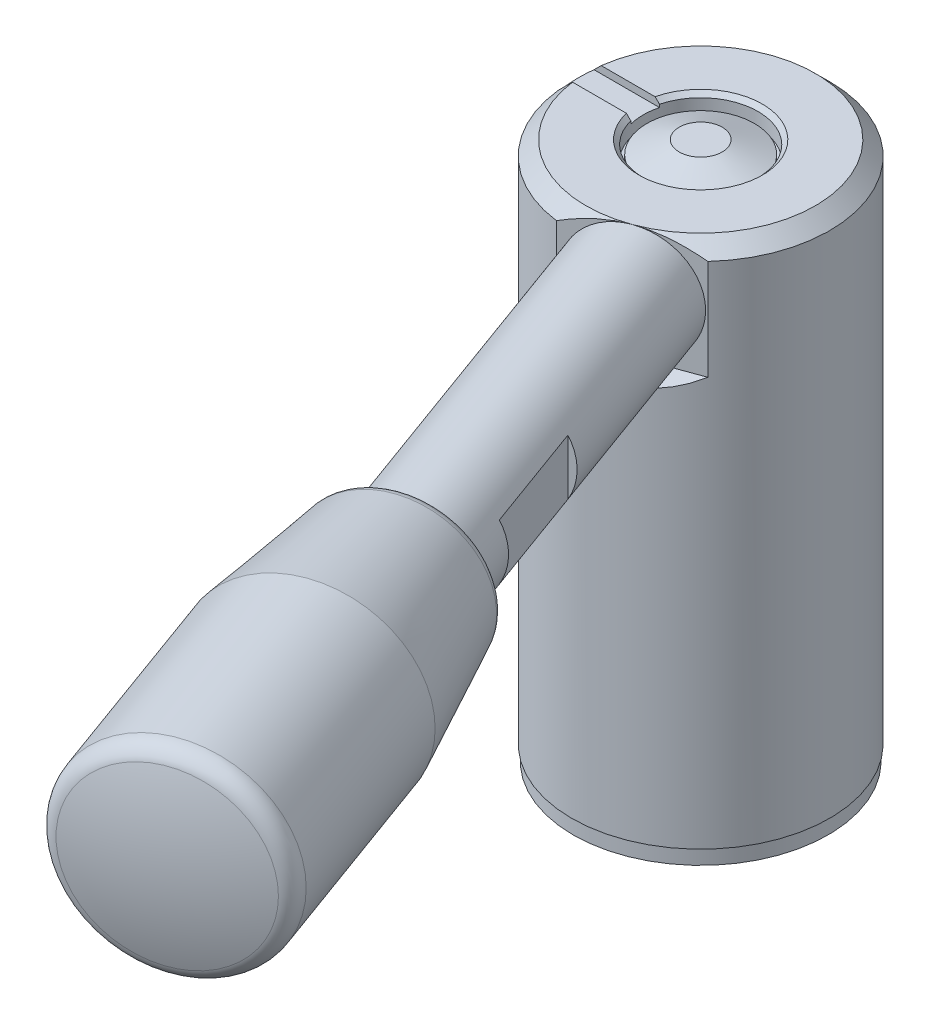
ISO-10303-21;
HEADER;
FILE_DESCRIPTION(('STEP AP214'),'2;1');
FILE_NAME('part.step','',(''),(''),'','','');
FILE_SCHEMA(('AUTOMOTIVE_DESIGN { 1 0 10303 214 1 1 1 1 }'));
ENDSEC;
DATA;
#1=APPLICATION_CONTEXT('core data for automotive mechanical design processes');
#2=APPLICATION_PROTOCOL_DEFINITION('international standard','automotive_design',2000,#1);
#3=PRODUCT_CONTEXT('',#1,'mechanical');
#4=PRODUCT('Part','Part','',(#3));
#5=PRODUCT_RELATED_PRODUCT_CATEGORY('part','',(#4));
#6=PRODUCT_DEFINITION_FORMATION('','',#4);
#7=PRODUCT_DEFINITION_CONTEXT('part definition',#1,'design');
#8=PRODUCT_DEFINITION('design','',#6,#7);
#9=PRODUCT_DEFINITION_SHAPE('','',#8);
#10=(LENGTH_UNIT() NAMED_UNIT(*) SI_UNIT(.MILLI.,.METRE.));
#11=(NAMED_UNIT(*) PLANE_ANGLE_UNIT() SI_UNIT($,.RADIAN.));
#12=(NAMED_UNIT(*) SI_UNIT($,.STERADIAN.) SOLID_ANGLE_UNIT());
#13=UNCERTAINTY_MEASURE_WITH_UNIT(LENGTH_MEASURE(1.E-05),#10,'distance_accuracy_value','');
#14=(GEOMETRIC_REPRESENTATION_CONTEXT(3) GLOBAL_UNCERTAINTY_ASSIGNED_CONTEXT((#13)) GLOBAL_UNIT_ASSIGNED_CONTEXT((#10,
#11,#12)) REPRESENTATION_CONTEXT('',''));
#15=CARTESIAN_POINT('',(0.,0.,0.));
#16=DIRECTION('',(0.,0.,1.));
#17=DIRECTION('',(1.,0.,0.));
#18=AXIS2_PLACEMENT_3D('',#15,#16,#17);
#19=CARTESIAN_POINT('',(6.5,-13.5,0.));
#20=DIRECTION('',(0.,1.,0.));
#21=DIRECTION('',(0.,0.,1.));
#22=AXIS2_PLACEMENT_3D('',#19,#20,#21);
#23=PLANE('',#22);
#24=CARTESIAN_POINT('',(0.,-13.5,0.));
#25=DIRECTION('',(0.,1.,0.));
#26=DIRECTION('',(0.,0.,1.));
#27=AXIS2_PLACEMENT_3D('',#24,#25,#26);
#28=CIRCLE('',#27,4.1);
#29=CARTESIAN_POINT('',(0.,-13.5,4.1));
#30=VERTEX_POINT('',#29);
#31=EDGE_CURVE('E11',#30,#30,#28,.F.);
#32=ORIENTED_EDGE('',*,*,#31,.T.);
#33=EDGE_LOOP('',(#32));
#34=FACE_BOUND('',#33,.T.);
#35=ADVANCED_FACE('F18',(#34),#23,.F.);
#36=CARTESIAN_POINT('',(0.,-14.55,0.));
#37=DIRECTION('',(0.,1.,0.));
#38=DIRECTION('',(0.,0.,1.));
#39=AXIS2_PLACEMENT_3D('',#36,#37,#38);
#40=PLANE('',#39);
#41=CARTESIAN_POINT('',(0.,-14.55,0.));
#42=DIRECTION('',(0.,-1.,0.));
#43=DIRECTION('',(0.,0.,-1.));
#44=AXIS2_PLACEMENT_3D('',#41,#42,#43);
#45=CIRCLE('',#44,4.1);
#46=CARTESIAN_POINT('',(0.,-14.55,-4.1));
#47=VERTEX_POINT('',#46);
#48=EDGE_CURVE('E398',#47,#47,#45,.T.);
#49=ORIENTED_EDGE('',*,*,#48,.F.);
#50=EDGE_LOOP('',(#49));
#51=FACE_BOUND('',#50,.T.);
#52=CARTESIAN_POINT('',(0.,-14.55,0.));
#53=DIRECTION('',(0.,1.,0.));
#54=DIRECTION('',(0.,0.,1.));
#55=AXIS2_PLACEMENT_3D('',#52,#53,#54);
#56=CIRCLE('',#55,8.9);
#57=CARTESIAN_POINT('',(0.,-14.55,8.9));
#58=VERTEX_POINT('',#57);
#59=EDGE_CURVE('E27',#58,#58,#56,.F.);
#60=ORIENTED_EDGE('',*,*,#59,.T.);
#61=EDGE_LOOP('',(#60));
#62=FACE_BOUND('',#61,.T.);
#63=ADVANCED_FACE('F166',(#51,#62),#40,.F.);
#64=CARTESIAN_POINT('',(0.,-14.55,0.));
#65=DIRECTION('',(0.,-1.,0.));
#66=DIRECTION('',(0.,0.,-1.));
#67=AXIS2_PLACEMENT_3D('',#64,#65,#66);
#68=CYLINDRICAL_SURFACE('',#67,4.1);
#69=ORIENTED_EDGE('',*,*,#31,.F.);
#70=EDGE_LOOP('',(#69));
#71=FACE_BOUND('',#70,.T.);
#72=ORIENTED_EDGE('',*,*,#48,.T.);
#73=EDGE_LOOP('',(#72));
#74=FACE_BOUND('',#73,.T.);
#75=ADVANCED_FACE('F20',(#71,#74),#68,.F.);
#76=CARTESIAN_POINT('',(-5.72107244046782,15.,10.5957222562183));
#77=DIRECTION('',(-0.342020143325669,0.,-0.939692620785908));
#78=DIRECTION('',(-0.939692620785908,0.,0.342020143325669));
#79=AXIS2_PLACEMENT_3D('',#76,#77,#78);
#80=PLANE('',#79);
#81=CARTESIAN_POINT('',(2.73616114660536,19.,7.51754096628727));
#82=DIRECTION('',(-0.342020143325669,0.,-0.939692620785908));
#83=DIRECTION('',(-0.939692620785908,0.,0.342020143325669));
#84=AXIS2_PLACEMENT_3D('',#81,#82,#83);
#85=CIRCLE('',#84,4.);
#86=CARTESIAN_POINT('',(2.73616114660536,23.,7.51754096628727));
#87=VERTEX_POINT('',#86);
#88=CARTESIAN_POINT('',(2.73616114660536,15.,7.51754096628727));
#89=VERTEX_POINT('',#88);
#90=EDGE_CURVE('E382',#87,#89,#85,.T.);
#91=ORIENTED_EDGE('',*,*,#90,.T.);
#92=DIRECTION('',(0.939692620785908,0.,-0.342020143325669));
#93=VECTOR('',#92,1.);
#94=CARTESIAN_POINT('',(-5.72107244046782,15.,10.5957222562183));
#95=LINE('',#94,#93);
#96=CARTESIAN_POINT('',(6.61061307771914,15.,6.10735578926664));
#97=VERTEX_POINT('',#96);
#98=EDGE_CURVE('E229',#89,#97,#95,.T.);
#99=ORIENTED_EDGE('',*,*,#98,.T.);
#100=DIRECTION('',(0.,1.,0.));
#101=VECTOR('',#100,1.);
#102=CARTESIAN_POINT('',(6.61061307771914,21.3127645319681,6.10735578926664));
#103=LINE('',#102,#101);
#104=CARTESIAN_POINT('',(6.61061307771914,22.,6.10735578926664));
#105=VERTEX_POINT('',#104);
#106=EDGE_CURVE('E238',#105,#97,#103,.F.);
#107=ORIENTED_EDGE('',*,*,#106,.F.);
#108=CARTESIAN_POINT('',(6.61102329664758,21.9998,6.10720648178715));
#109=CARTESIAN_POINT('',(6.3380128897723,22.1328463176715,6.20657414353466));
#110=CARTESIAN_POINT('',(6.06074994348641,22.2569796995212,6.30748960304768));
#111=CARTESIAN_POINT('',(5.49682133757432,22.4822031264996,6.51274282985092));
#112=CARTESIAN_POINT('',(5.2101211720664,22.5831945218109,6.61709315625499));
#113=CARTESIAN_POINT('',(4.63246044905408,22.7545940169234,6.82734446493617));
#114=CARTESIAN_POINT('',(4.34160253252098,22.8253797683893,6.9332080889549));
#115=CARTESIAN_POINT('',(3.90147775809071,22.9059199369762,7.09340040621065));
#116=CARTESIAN_POINT('',(3.75422096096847,22.9284876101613,7.14699749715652));
#117=CARTESIAN_POINT('',(3.458746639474,22.9646435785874,7.25454135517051));
#118=CARTESIAN_POINT('',(3.31052931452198,22.9782336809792,7.3084880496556));
#119=CARTESIAN_POINT('',(3.02523073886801,22.9954087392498,7.41232823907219));
#120=CARTESIAN_POINT('',(2.88818627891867,22.9996938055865,7.46220834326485));
#121=CARTESIAN_POINT('',(2.61408935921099,23.0002744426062,7.56197146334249));
#122=CARTESIAN_POINT('',(2.47703690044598,22.9965704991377,7.61185447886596));
#123=CARTESIAN_POINT('',(2.20326051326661,22.981244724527,7.71150093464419));
#124=CARTESIAN_POINT('',(2.06653676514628,22.9696192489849,7.76126430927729));
#125=CARTESIAN_POINT('',(1.79385176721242,22.9386890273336,7.86051353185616));
#126=CARTESIAN_POINT('',(1.65789063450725,22.919383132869,7.90999933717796));
#127=CARTESIAN_POINT('',(1.25171838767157,22.8504759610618,8.05783394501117));
#128=CARTESIAN_POINT('',(0.983107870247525,22.7898785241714,8.15560017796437));
#129=CARTESIAN_POINT('',(0.452105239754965,22.6433671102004,8.34886932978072));
#130=CARTESIAN_POINT('',(0.189715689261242,22.5574428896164,8.44437131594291));
#131=CARTESIAN_POINT('',(-0.251178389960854,22.3934037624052,8.60484363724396));
#132=CARTESIAN_POINT('',(-0.431443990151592,22.3205533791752,8.67045494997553));
#133=CARTESIAN_POINT('',(-0.698937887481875,22.2047958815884,8.76781476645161));
#134=CARTESIAN_POINT('',(-0.787448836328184,22.1652130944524,8.80003011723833));
#135=CARTESIAN_POINT('',(-0.963675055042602,22.083999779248,8.86417121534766));
#136=CARTESIAN_POINT('',(-1.05139003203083,22.0423685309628,8.89609685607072));
#137=CARTESIAN_POINT('',(-1.13870100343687,21.9998,8.92787545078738));
#138=B_SPLINE_CURVE_WITH_KNOTS('',3,(#108,#109,#110,#111,#112,#113,#114,#115,#116,#117,#118,
#119,#120,#121,#122,#123,#124,#125,#126,#127,#128,#129,#130,#131,#132,#133,#134,#135,#136,#137),
.UNSPECIFIED.,.F.,.F.,(4,2,2,2,2,2,2,2,2,2,2,2,2,2,4),(0.,0.959080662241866,1.92217664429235,
2.87285099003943,3.34760856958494,3.82227055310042,4.25976488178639,4.69723260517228,
5.13490172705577,5.57263631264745,6.4477536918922,7.32322550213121,7.9385890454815,
8.24507912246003,8.55167773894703),.UNSPECIFIED.);
#139=EDGE_CURVE('E264',#105,#87,#138,.T.);
#140=ORIENTED_EDGE('',*,*,#139,.T.);
#141=EDGE_LOOP('',(#91,#99,#107,#140));
#142=FACE_BOUND('',#141,.T.);
#143=ADVANCED_FACE('F272',(#142),#80,.F.);
#144=CARTESIAN_POINT('',(6.5,-13.5,0.));
#145=DIRECTION('',(0.,1.,0.));
#146=DIRECTION('',(0.,0.,1.));
#147=AXIS2_PLACEMENT_3D('',#144,#145,#146);
#148=PLANE('',#147);
#149=CARTESIAN_POINT('',(0.,-13.5,0.));
#150=DIRECTION('',(0.,1.,0.));
#151=DIRECTION('',(0.,0.,1.));
#152=AXIS2_PLACEMENT_3D('',#149,#150,#151);
#153=CIRCLE('',#152,9.);
#154=CARTESIAN_POINT('',(0.,-13.5,9.));
#155=VERTEX_POINT('',#154);
#156=EDGE_CURVE('E247',#155,#155,#153,.T.);
#157=ORIENTED_EDGE('',*,*,#156,.F.);
#158=EDGE_LOOP('',(#157));
#159=FACE_BOUND('',#158,.T.);
#160=CARTESIAN_POINT('',(0.,-13.5,0.));
#161=DIRECTION('',(0.,1.,0.));
#162=DIRECTION('',(0.,0.,1.));
#163=AXIS2_PLACEMENT_3D('',#160,#161,#162);
#164=CIRCLE('',#163,8.9);
#165=CARTESIAN_POINT('',(0.,-13.5,8.9));
#166=VERTEX_POINT('',#165);
#167=EDGE_CURVE('E796',#166,#166,#164,.F.);
#168=ORIENTED_EDGE('',*,*,#167,.F.);
#169=EDGE_LOOP('',(#168));
#170=FACE_BOUND('',#169,.T.);
#171=ADVANCED_FACE('F280',(#159,#170),#148,.F.);
#172=CARTESIAN_POINT('',(2.,21.7,0.));
#173=DIRECTION('',(0.,-1.,0.));
#174=DIRECTION('',(0.,0.,-1.));
#175=AXIS2_PLACEMENT_3D('',#172,#173,#174);
#176=PLANE('',#175);
#177=CARTESIAN_POINT('',(0.,21.7,0.));
#178=DIRECTION('',(0.,1.,0.));
#179=DIRECTION('',(0.,0.,1.));
#180=AXIS2_PLACEMENT_3D('',#177,#178,#179);
#181=CIRCLE('',#180,4.);
#182=CARTESIAN_POINT('',(0.,21.7,4.));
#183=VERTEX_POINT('',#182);
#184=EDGE_CURVE('E244',#183,#183,#181,.T.);
#185=ORIENTED_EDGE('',*,*,#184,.T.);
#186=EDGE_LOOP('',(#185));
#187=FACE_BOUND('',#186,.T.);
#188=CARTESIAN_POINT('',(0.,21.7,0.));
#189=DIRECTION('',(0.,-1.,0.));
#190=DIRECTION('',(0.,0.,-1.));
#191=AXIS2_PLACEMENT_3D('',#188,#189,#190);
#192=CIRCLE('',#191,3.75);
#193=CARTESIAN_POINT('',(0.,21.7,-3.75));
#194=VERTEX_POINT('',#193);
#195=EDGE_CURVE('E800',#194,#194,#192,.F.);
#196=ORIENTED_EDGE('',*,*,#195,.F.);
#197=EDGE_LOOP('',(#196));
#198=FACE_BOUND('',#197,.T.);
#199=ADVANCED_FACE('F276',(#187,#198),#176,.F.);
#200=CARTESIAN_POINT('',(0.,23.,0.));
#201=DIRECTION('',(0.,-1.,0.));
#202=DIRECTION('',(0.,0.,-1.));
#203=AXIS2_PLACEMENT_3D('',#200,#201,#202);
#204=CONICAL_SURFACE('',#203,8.,0.785398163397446);
#205=CARTESIAN_POINT('',(-9.81219070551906,21.1369839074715,1.));
#206=CARTESIAN_POINT('',(-9.51142743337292,21.4362321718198,1.));
#207=CARTESIAN_POINT('',(-9.21056894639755,21.7353846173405,1.));
#208=CARTESIAN_POINT('',(-8.60866153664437,22.3334978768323,1.));
#209=CARTESIAN_POINT('',(-8.30761261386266,22.6324586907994,1.));
#210=CARTESIAN_POINT('',(-8.00646847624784,22.9313236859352,1.));
#211=B_SPLINE_CURVE_WITH_KNOTS('',3,(#205,#206,#207,#208,#209,#210),.UNSPECIFIED.,.F.,.F.,(4,2,
4),(0.,1.27282054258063,2.54564111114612),.UNSPECIFIED.);
#212=CARTESIAN_POINT('',(-8.94427190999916,22.,1.));
#213=VERTEX_POINT('',#212);
#214=CARTESIAN_POINT('',(-8.5,22.4413786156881,1.));
#215=VERTEX_POINT('',#214);
#216=EDGE_CURVE('E306',#213,#215,#211,.T.);
#217=ORIENTED_EDGE('',*,*,#216,.F.);
#218=CARTESIAN_POINT('',(0.,22.,0.));
#219=DIRECTION('',(0.,-1.,0.));
#220=DIRECTION('',(0.,0.,-1.));
#221=AXIS2_PLACEMENT_3D('',#218,#219,#220);
#222=CIRCLE('',#221,9.);
#223=CARTESIAN_POINT('',(-1.13829078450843,22.,8.92772614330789));
#224=VERTEX_POINT('',#223);
#225=EDGE_CURVE('E255',#224,#213,#222,.T.);
#226=ORIENTED_EDGE('',*,*,#225,.F.);
#227=EDGE_CURVE('E258',#87,#224,#138,.T.);
#228=ORIENTED_EDGE('',*,*,#227,.F.);
#229=CARTESIAN_POINT('',(0.,23.,0.));
#230=DIRECTION('',(0.,-1.,0.));
#231=DIRECTION('',(0.,0.,-1.));
#232=AXIS2_PLACEMENT_3D('',#229,#230,#231);
#233=CIRCLE('',#232,8.);
#234=CARTESIAN_POINT('',(-7.93725393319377,23.,1.));
#235=VERTEX_POINT('',#234);
#236=EDGE_CURVE('E250',#235,#87,#233,.F.);
#237=ORIENTED_EDGE('',*,*,#236,.F.);
#238=CARTESIAN_POINT('',(-14.8048009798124,16.1614646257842,1.));
#239=CARTESIAN_POINT('',(-14.2590456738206,16.7059659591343,1.));
#240=CARTESIAN_POINT('',(-13.7132342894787,17.2504111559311,1.));
#241=CARTESIAN_POINT('',(-12.6214249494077,18.3390932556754,1.));
#242=CARTESIAN_POINT('',(-12.0754269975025,18.8833301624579,1.));
#243=CARTESIAN_POINT('',(-10.9831813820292,19.9714884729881,1.));
#244=CARTESIAN_POINT('',(-10.4369337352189,20.5154098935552,1.));
#245=CARTESIAN_POINT('',(-9.3439865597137,21.60281936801,1.));
#246=CARTESIAN_POINT('',(-8.79728702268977,22.1463074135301,1.));
#247=CARTESIAN_POINT('',(-7.97663183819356,22.9609953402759,1.));
#248=CARTESIAN_POINT('',(-7.7029625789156,23.232483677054,1.));
#249=CARTESIAN_POINT('',(-7.15536134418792,23.7751919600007,1.));
#250=CARTESIAN_POINT('',(-6.88142937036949,24.0464119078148,1.));
#251=CARTESIAN_POINT('',(-6.33320794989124,24.5884603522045,1.));
#252=CARTESIAN_POINT('',(-6.05891852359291,24.8592888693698,0.999999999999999));
#253=CARTESIAN_POINT('',(-5.50978725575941,25.4003979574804,0.999999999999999));
#254=CARTESIAN_POINT('',(-5.23494540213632,25.6706785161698,0.999999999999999));
#255=CARTESIAN_POINT('',(-4.82200938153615,26.0754648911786,0.999999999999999));
#256=CARTESIAN_POINT('',(-4.68423874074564,26.2103006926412,0.999999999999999));
#257=CARTESIAN_POINT('',(-4.40841695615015,26.4796838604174,0.999999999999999));
#258=CARTESIAN_POINT('',(-4.27036581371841,26.6142312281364,0.999999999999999));
#259=CARTESIAN_POINT('',(-3.99390367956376,26.8829368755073,0.999999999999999));
#260=CARTESIAN_POINT('',(-3.85549271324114,27.017095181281,0.999999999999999));
#261=CARTESIAN_POINT('',(-3.5781685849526,27.284897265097,0.999999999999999));
#262=CARTESIAN_POINT('',(-3.43925541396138,27.4185410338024,0.999999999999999));
#263=CARTESIAN_POINT('',(-3.16069310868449,27.6851323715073,0.999999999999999));
#264=CARTESIAN_POINT('',(-3.02104379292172,27.8180797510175,0.999999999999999));
#265=CARTESIAN_POINT('',(-2.74073565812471,28.0828955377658,0.999999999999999));
#266=CARTESIAN_POINT('',(-2.60007688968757,28.2147639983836,0.999999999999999));
#267=CARTESIAN_POINT('',(-2.38788921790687,28.4113103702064,0.999999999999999));
#268=CARTESIAN_POINT('',(-2.31695057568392,28.476625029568,0.999999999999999));
#269=CARTESIAN_POINT('',(-2.17456634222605,28.6066968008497,0.999999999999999));
#270=CARTESIAN_POINT('',(-2.1031207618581,28.6714539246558,0.999999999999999));
#271=CARTESIAN_POINT('',(-1.95956535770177,28.800255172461,0.999999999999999));
#272=CARTESIAN_POINT('',(-1.88745542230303,28.8642991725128,0.999999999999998));
#273=CARTESIAN_POINT('',(-1.74234178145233,28.9913760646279,0.999999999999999));
#274=CARTESIAN_POINT('',(-1.66933801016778,29.0544088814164,0.999999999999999));
#275=CARTESIAN_POINT('',(-1.59577184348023,29.1167879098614,1.));
#276=B_SPLINE_CURVE_WITH_KNOTS('',3,(#238,#239,#240,#241,#242,#243,#244,#245,#246,#247,#248,
#249,#250,#251,#252,#253,#254,#255,#256,#257,#258,#259,#260,#261,#262,#263,#264,#265,#266,#267,
#268,#269,#270,#271,#272,#273,#274,#275),.UNSPECIFIED.,.F.,.F.,(4,2,2,2,2,2,2,2,2,2,2,2,2,2,2,2,
2,2,4),(0.,2.31278519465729,4.62552553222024,6.93812850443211,9.25077509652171,10.4072381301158,
11.5636940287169,12.7200867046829,13.8765049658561,14.4548237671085,15.0331397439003,
15.611415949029,16.1897025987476,16.7681391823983,17.3465469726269,17.6358276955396,
17.9251022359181,18.2144262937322,18.5037717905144),.UNSPECIFIED.);
#277=CARTESIAN_POINT('',(-8.44097150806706,22.5,1.));
#278=VERTEX_POINT('',#277);
#279=EDGE_CURVE('E230',#278,#235,#276,.T.);
#280=ORIENTED_EDGE('',*,*,#279,.F.);
#281=CARTESIAN_POINT('',(0.,22.5,0.));
#282=DIRECTION('',(0.,1.,0.));
#283=DIRECTION('',(0.,0.,1.));
#284=AXIS2_PLACEMENT_3D('',#281,#282,#283);
#285=CIRCLE('',#284,8.5);
#286=CARTESIAN_POINT('',(-8.5,22.5,0.));
#287=VERTEX_POINT('',#286);
#288=EDGE_CURVE('E208',#278,#287,#285,.F.);
#289=ORIENTED_EDGE('',*,*,#288,.T.);
#290=CARTESIAN_POINT('',(-8.5,21.5927058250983,-4.03077953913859));
#291=CARTESIAN_POINT('',(-8.5,21.7043856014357,-3.7701142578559));
#292=CARTESIAN_POINT('',(-8.5,21.8087057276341,-3.50603243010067));
#293=CARTESIAN_POINT('',(-8.5,21.9993142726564,-2.97070570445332));
#294=CARTESIAN_POINT('',(-8.5,22.0855552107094,-2.69944400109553));
#295=CARTESIAN_POINT('',(-8.5,22.2352008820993,-2.15397504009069));
#296=CARTESIAN_POINT('',(-8.5,22.2988595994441,-1.87983875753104));
#297=CARTESIAN_POINT('',(-8.5,22.4012872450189,-1.32717225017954));
#298=CARTESIAN_POINT('',(-8.5,22.4400838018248,-1.04864725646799));
#299=CARTESIAN_POINT('',(-8.5,22.4842274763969,-0.558802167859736));
#300=CARTESIAN_POINT('',(-8.5,22.4954956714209,-0.348004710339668));
#301=CARTESIAN_POINT('',(-8.5,22.502294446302,0.0738863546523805));
#302=CARTESIAN_POINT('',(-8.5,22.4978229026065,0.284979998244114));
#303=CARTESIAN_POINT('',(-8.5,22.4732617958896,0.706966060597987));
#304=CARTESIAN_POINT('',(-8.5,22.4531190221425,0.917855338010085));
#305=CARTESIAN_POINT('',(-8.5,22.3979110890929,1.33761983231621));
#306=CARTESIAN_POINT('',(-8.5,22.3628482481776,1.54649535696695));
#307=CARTESIAN_POINT('',(-8.5,22.2834641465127,1.93932396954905));
#308=CARTESIAN_POINT('',(-8.5,22.2405280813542,2.12356044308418));
#309=CARTESIAN_POINT('',(-8.5,22.1447109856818,2.48944321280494));
#310=CARTESIAN_POINT('',(-8.5,22.0918278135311,2.67108894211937));
#311=CARTESIAN_POINT('',(-8.5,21.9196493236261,3.21248196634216));
#312=CARTESIAN_POINT('',(-8.5,21.7869656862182,3.56802407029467));
#313=CARTESIAN_POINT('',(-8.5,21.5675504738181,4.09221852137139));
#314=CARTESIAN_POINT('',(-8.5,21.4910610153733,4.26533833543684));
#315=CARTESIAN_POINT('',(-8.5,21.3320990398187,4.60884840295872));
#316=CARTESIAN_POINT('',(-8.5,21.2496259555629,4.77923839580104));
#317=CARTESIAN_POINT('',(-8.5,21.0799382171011,5.11652059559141));
#318=CARTESIAN_POINT('',(-8.5,20.9927502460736,5.28342632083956));
#319=CARTESIAN_POINT('',(-8.5,20.8139205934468,5.61476355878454));
#320=CARTESIAN_POINT('',(-8.5,20.7222804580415,5.77919590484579));
#321=CARTESIAN_POINT('',(-8.5,20.6287207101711,5.94251075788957));
#322=B_SPLINE_CURVE_WITH_KNOTS('',3,(#290,#291,#292,#293,#294,#295,#296,#297,#298,#299,#300,
#301,#302,#303,#304,#305,#306,#307,#308,#309,#310,#311,#312,#313,#314,#315,#316,#317,#318,#319,
#320,#321),.UNSPECIFIED.,.F.,.F.,(4,2,2,2,2,2,2,2,2,2,2,2,2,2,2,4),(0.,0.850998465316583,
1.70420462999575,2.54748540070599,3.38982742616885,4.02256976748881,4.65539747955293,
5.29038334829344,5.92527058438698,6.49248607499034,7.05982382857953,8.19651738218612,
8.76424557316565,9.33202764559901,9.89687785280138,10.4615332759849),.UNSPECIFIED.);
#323=EDGE_CURVE('E417',#287,#215,#322,.T.);
#324=ORIENTED_EDGE('',*,*,#323,.T.);
#325=EDGE_LOOP('',(#217,#226,#228,#237,#280,#289,#324));
#326=FACE_BOUND('',#325,.T.);
#327=ADVANCED_FACE('F279',(#326),#204,.T.);
#328=CARTESIAN_POINT('',(0.,21.3127645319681,0.));
#329=DIRECTION('',(0.,1.,0.));
#330=DIRECTION('',(0.,0.,1.));
#331=AXIS2_PLACEMENT_3D('',#328,#329,#330);
#332=CYLINDRICAL_SURFACE('',#331,9.);
#333=ORIENTED_EDGE('',*,*,#156,.T.);
#334=EDGE_LOOP('',(#333));
#335=FACE_BOUND('',#334,.T.);
#336=ORIENTED_EDGE('',*,*,#225,.T.);
#337=DIRECTION('',(0.,1.,0.));
#338=VECTOR('',#337,1.);
#339=CARTESIAN_POINT('',(-8.94427190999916,21.3127645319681,1.));
#340=LINE('',#339,#338);
#341=CARTESIAN_POINT('',(-8.94427190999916,14.,1.));
#342=VERTEX_POINT('',#341);
#343=EDGE_CURVE('E361',#213,#342,#340,.F.);
#344=ORIENTED_EDGE('',*,*,#343,.T.);
#345=CARTESIAN_POINT('',(-8.94427190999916,14.,1.));
#346=CARTESIAN_POINT('',(-8.94427115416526,13.9719583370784,0.999999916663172));
#347=CARTESIAN_POINT('',(-8.94440395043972,13.9439301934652,0.998819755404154));
#348=CARTESIAN_POINT('',(-8.94492867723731,13.8880761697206,0.994112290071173));
#349=CARTESIAN_POINT('',(-8.94532058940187,13.8602502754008,0.990585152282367));
#350=CARTESIAN_POINT('',(-8.94687116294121,13.7774349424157,0.976519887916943));
#351=CARTESIAN_POINT('',(-8.94840471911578,13.7230029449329,0.962497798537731));
#352=CARTESIAN_POINT('',(-8.95229970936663,13.6172857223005,0.925564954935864));
#353=CARTESIAN_POINT('',(-8.9546614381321,13.5660016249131,0.902651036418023));
#354=CARTESIAN_POINT('',(-8.95994559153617,13.4680040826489,0.848592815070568));
#355=CARTESIAN_POINT('',(-8.96286795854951,13.4212901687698,0.817449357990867));
#356=CARTESIAN_POINT('',(-8.96895834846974,13.3335613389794,0.74767213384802));
#357=CARTESIAN_POINT('',(-8.97212727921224,13.2925692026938,0.709009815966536));
#358=CARTESIAN_POINT('',(-8.97834591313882,13.2176362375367,0.625348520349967));
#359=CARTESIAN_POINT('',(-8.98139559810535,13.1836964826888,0.580348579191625));
#360=CARTESIAN_POINT('',(-8.9870410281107,13.1237566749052,0.485149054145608));
#361=CARTESIAN_POINT('',(-8.98963558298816,13.0977773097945,0.434936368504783));
#362=CARTESIAN_POINT('',(-8.99406818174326,13.0546293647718,0.330830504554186));
#363=CARTESIAN_POINT('',(-8.99590629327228,13.0374599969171,0.276937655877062));
#364=CARTESIAN_POINT('',(-8.99861262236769,13.0124859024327,0.167234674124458));
#365=CARTESIAN_POINT('',(-8.99948481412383,13.0046427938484,0.111433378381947));
#366=CARTESIAN_POINT('',(-9.00017458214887,12.9984249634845,-0.000701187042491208));
#367=CARTESIAN_POINT('',(-8.9999921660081,13.0000501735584,-0.057034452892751));
#368=CARTESIAN_POINT('',(-8.99859646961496,13.0126921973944,-0.168370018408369));
#369=CARTESIAN_POINT('',(-8.99738774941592,13.0236674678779,-0.223377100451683));
#370=CARTESIAN_POINT('',(-8.9940804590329,13.0546332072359,-0.330763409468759));
#371=CARTESIAN_POINT('',(-8.99198187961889,13.0746237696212,-0.383142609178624));
#372=CARTESIAN_POINT('',(-8.9871228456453,13.1230980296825,-0.483917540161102));
#373=CARTESIAN_POINT('',(-8.98436096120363,13.1516001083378,-0.532304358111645));
#374=CARTESIAN_POINT('',(-8.97848501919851,13.216273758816,-0.623621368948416));
#375=CARTESIAN_POINT('',(-8.97537096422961,13.2524452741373,-0.66655160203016));
#376=CARTESIAN_POINT('',(-8.96912017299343,13.3316584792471,-0.745977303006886));
#377=CARTESIAN_POINT('',(-8.96598340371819,13.3747353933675,-0.782437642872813));
#378=CARTESIAN_POINT('',(-8.96005605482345,13.4664330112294,-0.847626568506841));
#379=CARTESIAN_POINT('',(-8.9572655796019,13.5150553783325,-0.876352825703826));
#380=CARTESIAN_POINT('',(-8.9523463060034,13.6164989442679,-0.925258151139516));
#381=CARTESIAN_POINT('',(-8.9502180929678,13.669323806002,-0.945429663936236));
#382=CARTESIAN_POINT('',(-8.94687363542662,13.7776008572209,-0.976576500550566));
#383=CARTESIAN_POINT('',(-8.94565601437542,13.8330489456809,-0.987565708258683));
#384=CARTESIAN_POINT('',(-8.9447318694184,13.9074081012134,-0.995878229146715));
#385=CARTESIAN_POINT('',(-8.94455949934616,13.925908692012,-0.997424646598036));
#386=CARTESIAN_POINT('',(-8.94432965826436,13.962936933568,-0.999484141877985));
#387=CARTESIAN_POINT('',(-8.94427199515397,13.9814644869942,-0.999998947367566));
#388=CARTESIAN_POINT('',(-8.94427190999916,14.,-1.));
#389=B_SPLINE_CURVE_WITH_KNOTS('',3,(#345,#346,#347,#348,#349,#350,#351,#352,#353,#354,#355,
#356,#357,#358,#359,#360,#361,#362,#363,#364,#365,#366,#367,#368,#369,#370,#371,#372,#373,#374,
#375,#376,#377,#378,#379,#380,#381,#382,#383,#384,#385,#386,#387,#388),.UNSPECIFIED.,.F.,.F.,(4,
2,2,2,2,2,2,2,2,2,2,2,2,2,2,2,2,2,2,2,2,4),(0.,0.0840730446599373,0.168140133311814,
0.335963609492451,0.503846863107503,0.671712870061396,0.84022920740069,1.00877118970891,
1.17774754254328,1.34670877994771,1.51497222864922,1.68323446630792,1.85075297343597,
2.01827321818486,2.18615787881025,2.35404130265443,2.5228100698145,2.6916295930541,
2.86059790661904,3.02931027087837,3.08498698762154,3.14057038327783),.UNSPECIFIED.);
#390=CARTESIAN_POINT('',(-8.94427190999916,14.,-1.));
#391=VERTEX_POINT('',#390);
#392=EDGE_CURVE('E296',#342,#391,#389,.T.);
#393=ORIENTED_EDGE('',*,*,#392,.T.);
#394=DIRECTION('',(0.,1.,0.));
#395=VECTOR('',#394,1.);
#396=CARTESIAN_POINT('',(-8.94427190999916,21.3127645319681,-1.));
#397=LINE('',#396,#395);
#398=CARTESIAN_POINT('',(-8.94427190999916,22.,-1.));
#399=VERTEX_POINT('',#398);
#400=EDGE_CURVE('E425',#391,#399,#397,.T.);
#401=ORIENTED_EDGE('',*,*,#400,.T.);
#402=EDGE_CURVE('E254',#399,#105,#222,.T.);
#403=ORIENTED_EDGE('',*,*,#402,.T.);
#404=ORIENTED_EDGE('',*,*,#106,.T.);
#405=CARTESIAN_POINT('',(0.,23.,0.));
#406=DIRECTION('',(-0.241844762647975,-0.707106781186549,-0.664463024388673));
#407=DIRECTION('',(-0.241844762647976,0.707106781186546,-0.664463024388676));
#408=AXIS2_PLACEMENT_3D('',#405,#406,#407);
#409=ELLIPSE('',#408,12.7279220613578,9.);
#410=CARTESIAN_POINT('',(-1.13829078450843,15.,8.92772614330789));
#411=VERTEX_POINT('',#410);
#412=EDGE_CURVE('E265',#97,#411,#409,.T.);
#413=ORIENTED_EDGE('',*,*,#412,.T.);
#414=DIRECTION('',(0.,1.,0.));
#415=VECTOR('',#414,1.);
#416=CARTESIAN_POINT('',(-1.13829078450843,21.3127645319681,8.92772614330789));
#417=LINE('',#416,#415);
#418=EDGE_CURVE('E241',#411,#224,#417,.T.);
#419=ORIENTED_EDGE('',*,*,#418,.T.);
#420=EDGE_LOOP('',(#336,#344,#393,#401,#403,#404,#413,#419));
#421=FACE_BOUND('',#420,.T.);
#422=ADVANCED_FACE('F290',(#335,#421),#332,.T.);
#423=CARTESIAN_POINT('',(4.,23.,0.));
#424=DIRECTION('',(0.,-1.,0.));
#425=DIRECTION('',(0.,0.,-1.));
#426=AXIS2_PLACEMENT_3D('',#423,#424,#425);
#427=PLANE('',#426);
#428=CARTESIAN_POINT('',(-7.93725393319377,23.,-1.));
#429=VERTEX_POINT('',#428);
#430=EDGE_CURVE('E251',#87,#429,#233,.F.);
#431=ORIENTED_EDGE('',*,*,#430,.T.);
#432=DIRECTION('',(-1.,0.,0.));
#433=VECTOR('',#432,1.);
#434=CARTESIAN_POINT('',(-8.94427190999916,23.,-1.));
#435=LINE('',#434,#433);
#436=CARTESIAN_POINT('',(-4.18210473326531,23.,-1.));
#437=VERTEX_POINT('',#436);
#438=EDGE_CURVE('E349',#437,#429,#435,.T.);
#439=ORIENTED_EDGE('',*,*,#438,.F.);
#440=CARTESIAN_POINT('',(0.,23.,0.));
#441=DIRECTION('',(0.,-1.,0.));
#442=DIRECTION('',(0.,0.,-1.));
#443=AXIS2_PLACEMENT_3D('',#440,#441,#442);
#444=CIRCLE('',#443,4.3);
#445=CARTESIAN_POINT('',(-4.18210473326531,23.,1.));
#446=VERTEX_POINT('',#445);
#447=EDGE_CURVE('E371',#437,#446,#444,.T.);
#448=ORIENTED_EDGE('',*,*,#447,.T.);
#449=DIRECTION('',(1.,0.,0.));
#450=VECTOR('',#449,1.);
#451=CARTESIAN_POINT('',(-8.94427190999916,23.,1.));
#452=LINE('',#451,#450);
#453=EDGE_CURVE('E42',#235,#446,#452,.T.);
#454=ORIENTED_EDGE('',*,*,#453,.F.);
#455=ORIENTED_EDGE('',*,*,#236,.T.);
#456=EDGE_LOOP('',(#431,#439,#448,#454,#455));
#457=FACE_BOUND('',#456,.T.);
#458=ADVANCED_FACE('F286',(#457),#427,.F.);
#459=CARTESIAN_POINT('',(0.,21.3127645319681,0.));
#460=DIRECTION('',(0.,1.,0.));
#461=DIRECTION('',(0.,0.,1.));
#462=AXIS2_PLACEMENT_3D('',#459,#460,#461);
#463=CYLINDRICAL_SURFACE('',#462,4.);
#464=CARTESIAN_POINT('',(0.,22.7,0.));
#465=DIRECTION('',(0.,-1.,0.));
#466=DIRECTION('',(0.,0.,-1.));
#467=AXIS2_PLACEMENT_3D('',#464,#465,#466);
#468=CIRCLE('',#467,4.);
#469=CARTESIAN_POINT('',(-3.87298334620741,22.7,1.));
#470=VERTEX_POINT('',#469);
#471=CARTESIAN_POINT('',(-3.87298334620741,22.7,-1.));
#472=VERTEX_POINT('',#471);
#473=EDGE_CURVE('E822',#470,#472,#468,.F.);
#474=ORIENTED_EDGE('',*,*,#473,.T.);
#475=DIRECTION('',(0.,1.,0.));
#476=VECTOR('',#475,1.);
#477=CARTESIAN_POINT('',(-3.87298334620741,22.5,-1.));
#478=LINE('',#477,#476);
#479=CARTESIAN_POINT('',(-3.87298334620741,22.5,-1.));
#480=VERTEX_POINT('',#479);
#481=EDGE_CURVE('E355',#480,#472,#478,.T.);
#482=ORIENTED_EDGE('',*,*,#481,.F.);
#483=CARTESIAN_POINT('',(0.,22.5,0.));
#484=DIRECTION('',(0.,-1.,0.));
#485=DIRECTION('',(0.,0.,1.));
#486=AXIS2_PLACEMENT_3D('',#483,#484,#485);
#487=CIRCLE('',#486,4.);
#488=CARTESIAN_POINT('',(-3.87298334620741,22.5,1.));
#489=VERTEX_POINT('',#488);
#490=EDGE_CURVE('E351',#489,#480,#487,.T.);
#491=ORIENTED_EDGE('',*,*,#490,.F.);
#492=DIRECTION('',(0.,1.,0.));
#493=VECTOR('',#492,1.);
#494=CARTESIAN_POINT('',(-3.87298334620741,22.5,1.));
#495=LINE('',#494,#493);
#496=EDGE_CURVE('E352',#489,#470,#495,.T.);
#497=ORIENTED_EDGE('',*,*,#496,.T.);
#498=EDGE_LOOP('',(#474,#482,#491,#497));
#499=FACE_BOUND('',#498,.T.);
#500=ORIENTED_EDGE('',*,*,#184,.F.);
#501=EDGE_LOOP('',(#500));
#502=FACE_BOUND('',#501,.T.);
#503=ADVANCED_FACE('F283',(#499,#502),#463,.F.);
#504=CARTESIAN_POINT('',(-8.00646847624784,22.9313236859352,-1.));
#505=CARTESIAN_POINT('',(-8.30761261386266,22.6324586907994,-1.));
#506=CARTESIAN_POINT('',(-8.60866153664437,22.3334978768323,-1.));
#507=CARTESIAN_POINT('',(-9.21056894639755,21.7353846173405,-1.));
#508=CARTESIAN_POINT('',(-9.51142743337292,21.4362321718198,-1.));
#509=CARTESIAN_POINT('',(-9.81219070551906,21.1369839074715,-1.));
#510=B_SPLINE_CURVE_WITH_KNOTS('',3,(#504,#505,#506,#507,#508,#509),.UNSPECIFIED.,.F.,.F.,(4,2,
4),(0.,1.27282056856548,2.54564111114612),.UNSPECIFIED.);
#511=CARTESIAN_POINT('',(-8.5,22.4413786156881,-1.));
#512=VERTEX_POINT('',#511);
#513=EDGE_CURVE('E325',#512,#399,#510,.T.);
#514=ORIENTED_EDGE('',*,*,#513,.F.);
#515=EDGE_CURVE('E342',#512,#287,#322,.T.);
#516=ORIENTED_EDGE('',*,*,#515,.T.);
#517=CARTESIAN_POINT('',(-8.44097150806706,22.5,-1.));
#518=VERTEX_POINT('',#517);
#519=EDGE_CURVE('E207',#287,#518,#285,.F.);
#520=ORIENTED_EDGE('',*,*,#519,.T.);
#521=CARTESIAN_POINT('',(-1.59577184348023,29.1167879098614,-1.));
#522=CARTESIAN_POINT('',(-1.66597602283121,29.0572640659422,-1.));
#523=CARTESIAN_POINT('',(-1.73566555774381,28.9971413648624,-1.));
#524=CARTESIAN_POINT('',(-1.87422034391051,28.875961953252,-1.));
#525=CARTESIAN_POINT('',(-1.94308565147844,28.8149053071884,-1.));
#526=CARTESIAN_POINT('',(-2.08019434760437,28.6921244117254,-1.));
#527=CARTESIAN_POINT('',(-2.14843784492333,28.6304002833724,-1.));
#528=CARTESIAN_POINT('',(-2.2844467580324,28.5064252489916,-1.));
#529=CARTESIAN_POINT('',(-2.35221216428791,28.4441743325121,-1.));
#530=CARTESIAN_POINT('',(-2.55491316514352,28.2568451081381,-1.));
#531=CARTESIAN_POINT('',(-2.68928739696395,28.1311597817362,-1.));
#532=CARTESIAN_POINT('',(-2.95706172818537,27.8787435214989,-1.));
#533=CARTESIAN_POINT('',(-3.09046177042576,27.7520125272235,-1.));
#534=CARTESIAN_POINT('',(-3.43576129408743,27.4222268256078,-1.));
#535=CARTESIAN_POINT('',(-3.64713956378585,27.218626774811,-1.));
#536=CARTESIAN_POINT('',(-4.0688745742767,26.8103711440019,-1.));
#537=CARTESIAN_POINT('',(-4.27923130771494,26.6057155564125,-1.));
#538=CARTESIAN_POINT('',(-4.69927402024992,26.1957216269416,-1.));
#539=CARTESIAN_POINT('',(-4.90896000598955,25.9903832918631,-1.));
#540=CARTESIAN_POINT('',(-5.32787378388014,25.5792396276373,-1.));
#541=CARTESIAN_POINT('',(-5.53710157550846,25.3734342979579,-1.));
#542=CARTESIAN_POINT('',(-6.16443777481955,24.7553960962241,-1.));
#543=CARTESIAN_POINT('',(-6.58206363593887,24.342673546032,-1.));
#544=CARTESIAN_POINT('',(-7.41660192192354,23.516511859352,-1.));
#545=CARTESIAN_POINT('',(-7.8335143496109,23.1030727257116,-1.));
#546=CARTESIAN_POINT('',(-8.79743581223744,22.1461589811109,-1.));
#547=CARTESIAN_POINT('',(-9.34428456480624,21.6025229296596,-1.));
#548=CARTESIAN_POINT('',(-10.4375408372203,20.5148058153,-1.));
#549=CARTESIAN_POINT('',(-10.9839483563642,19.9707247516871,-1.));
#550=CARTESIAN_POINT('',(-12.0762050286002,18.8825546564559,-1.));
#551=CARTESIAN_POINT('',(-12.6220543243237,18.338465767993,-1.));
#552=CARTESIAN_POINT('',(-13.7135547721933,17.2500915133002,-1.));
#553=CARTESIAN_POINT('',(-14.2592059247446,16.7058061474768,-1.));
#554=CARTESIAN_POINT('',(-14.8048009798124,16.1614646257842,-1.));
#555=B_SPLINE_CURVE_WITH_KNOTS('',3,(#521,#522,#523,#524,#525,#526,#527,#528,#529,#530,#531,
#532,#533,#534,#535,#536,#537,#538,#539,#540,#541,#542,#543,#544,#545,#546,#547,#548,#549,#550,
#551,#552,#553,#554),.UNSPECIFIED.,.F.,.F.,(4,2,2,2,2,2,2,2,2,2,2,2,2,2,2,2,4),(0.,
0.276114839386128,0.552210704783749,0.828257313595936,1.1043094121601,1.65627682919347,
2.20827637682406,3.08872547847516,3.96918090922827,4.84962759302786,5.73007528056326,
7.49153899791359,9.25299573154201,11.5662728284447,13.879553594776,16.1916645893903,
18.5037708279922),.UNSPECIFIED.);
#556=EDGE_CURVE('E221',#429,#518,#555,.T.);
#557=ORIENTED_EDGE('',*,*,#556,.F.);
#558=ORIENTED_EDGE('',*,*,#430,.F.);
#559=ORIENTED_EDGE('',*,*,#139,.F.);
#560=ORIENTED_EDGE('',*,*,#402,.F.);
#561=EDGE_LOOP('',(#514,#516,#520,#557,#558,#559,#560));
#562=FACE_BOUND('',#561,.T.);
#563=ADVANCED_FACE('F187',(#562),#204,.T.);
#564=CARTESIAN_POINT('',(-5.37905229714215,14.,11.5354148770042));
#565=DIRECTION('',(-0.241844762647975,-0.707106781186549,-0.664463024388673));
#566=DIRECTION('',(0.,0.684791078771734,-0.728739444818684));
#567=AXIS2_PLACEMENT_3D('',#564,#565,#566);
#568=PLANE('',#567);
#569=EDGE_CURVE('E236',#411,#89,#95,.T.);
#570=ORIENTED_EDGE('',*,*,#569,.F.);
#571=ORIENTED_EDGE('',*,*,#412,.F.);
#572=ORIENTED_EDGE('',*,*,#98,.F.);
#573=EDGE_LOOP('',(#570,#571,#572));
#574=FACE_BOUND('',#573,.T.);
#575=ADVANCED_FACE('F270',(#574),#568,.F.);
#576=CARTESIAN_POINT('',(2.73616114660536,19.,7.51754096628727));
#577=DIRECTION('',(-0.342020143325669,0.,-0.939692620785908));
#578=DIRECTION('',(-0.939692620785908,0.,0.342020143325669));
#579=AXIS2_PLACEMENT_3D('',#576,#577,#578);
#580=CIRCLE('',#579,4.);
#581=EDGE_CURVE('E384',#87,#89,#580,.F.);
#582=ORIENTED_EDGE('',*,*,#581,.F.);
#583=ORIENTED_EDGE('',*,*,#227,.T.);
#584=ORIENTED_EDGE('',*,*,#418,.F.);
#585=ORIENTED_EDGE('',*,*,#569,.T.);
#586=EDGE_LOOP('',(#582,#583,#584,#585));
#587=FACE_BOUND('',#586,.T.);
#588=ADVANCED_FACE('F185',(#587),#80,.F.);
#589=CARTESIAN_POINT('',(0.,22.7,0.));
#590=DIRECTION('',(0.,1.,0.));
#591=DIRECTION('',(0.,0.,1.));
#592=AXIS2_PLACEMENT_3D('',#589,#590,#591);
#593=CONICAL_SURFACE('',#592,4.,0.785398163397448);
#594=CARTESIAN_POINT('',(-3.40283728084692,22.2467311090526,-1.));
#595=CARTESIAN_POINT('',(-3.52324861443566,22.362270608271,-1.));
#596=CARTESIAN_POINT('',(-3.64342984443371,22.4780492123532,-1.));
#597=CARTESIAN_POINT('',(-3.88342288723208,22.709987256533,-1.));
#598=CARTESIAN_POINT('',(-4.00323470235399,22.8261466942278,-1.));
#599=CARTESIAN_POINT('',(-4.24258087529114,23.0587501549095,-1.));
#600=CARTESIAN_POINT('',(-4.3621152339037,23.1751941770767,-1.));
#601=CARTESIAN_POINT('',(-4.6009624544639,23.4083106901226,-1.));
#602=CARTESIAN_POINT('',(-4.72027531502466,23.5249831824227,-1.));
#603=CARTESIAN_POINT('',(-4.83950448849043,23.6417409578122,-1.));
#604=B_SPLINE_CURVE_WITH_KNOTS('',3,(#594,#595,#596,#597,#598,#599,#600,#601,#602,#603),
.UNSPECIFIED.,.F.,.F.,(4,2,2,2,4),(0.,0.500632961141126,1.00126276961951,1.50189113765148,
2.00252262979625),.UNSPECIFIED.);
#605=EDGE_CURVE('E200',#472,#437,#604,.T.);
#606=ORIENTED_EDGE('',*,*,#605,.F.);
#607=ORIENTED_EDGE('',*,*,#473,.F.);
#608=CARTESIAN_POINT('',(-4.83950448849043,23.6417409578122,1.));
#609=CARTESIAN_POINT('',(-4.72027531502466,23.5249831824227,0.999999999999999));
#610=CARTESIAN_POINT('',(-4.6009624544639,23.4083106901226,0.999999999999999));
#611=CARTESIAN_POINT('',(-4.3621152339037,23.1751941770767,0.999999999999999));
#612=CARTESIAN_POINT('',(-4.24258087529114,23.0587501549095,1.));
#613=CARTESIAN_POINT('',(-4.00323470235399,22.8261466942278,1.));
#614=CARTESIAN_POINT('',(-3.88342288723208,22.709987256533,0.999999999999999));
#615=CARTESIAN_POINT('',(-3.64342984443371,22.4780492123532,0.999999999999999));
#616=CARTESIAN_POINT('',(-3.52324861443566,22.362270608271,0.999999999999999));
#617=CARTESIAN_POINT('',(-3.40283728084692,22.2467311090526,1.));
#618=B_SPLINE_CURVE_WITH_KNOTS('',3,(#608,#609,#610,#611,#612,#613,#614,#615,#616,#617),
.UNSPECIFIED.,.F.,.F.,(4,2,2,2,4),(0.,0.500631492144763,1.00125986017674,1.50188966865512,
2.00252262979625),.UNSPECIFIED.);
#619=EDGE_CURVE('E192',#446,#470,#618,.T.);
#620=ORIENTED_EDGE('',*,*,#619,.F.);
#621=ORIENTED_EDGE('',*,*,#447,.F.);
#622=EDGE_LOOP('',(#606,#607,#620,#621));
#623=FACE_BOUND('',#622,.T.);
#624=ADVANCED_FACE('F180',(#623),#593,.F.);
#625=CARTESIAN_POINT('',(-8.94427190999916,22.5,-1.));
#626=DIRECTION('',(0.,0.,-1.));
#627=DIRECTION('',(-1.,0.,0.));
#628=AXIS2_PLACEMENT_3D('',#625,#626,#627);
#629=PLANE('',#628);
#630=ORIENTED_EDGE('',*,*,#556,.T.);
#631=DIRECTION('',(-1.,0.,0.));
#632=VECTOR('',#631,1.);
#633=CARTESIAN_POINT('',(-8.94427190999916,22.5,-1.));
#634=LINE('',#633,#632);
#635=EDGE_CURVE('E346',#480,#518,#634,.T.);
#636=ORIENTED_EDGE('',*,*,#635,.F.);
#637=ORIENTED_EDGE('',*,*,#481,.T.);
#638=ORIENTED_EDGE('',*,*,#605,.T.);
#639=ORIENTED_EDGE('',*,*,#438,.T.);
#640=EDGE_LOOP('',(#630,#636,#637,#638,#639));
#641=FACE_BOUND('',#640,.T.);
#642=ADVANCED_FACE('F184',(#641),#629,.F.);
#643=CARTESIAN_POINT('',(-8.94427190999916,22.5,1.));
#644=DIRECTION('',(0.,0.,1.));
#645=DIRECTION('',(1.,0.,0.));
#646=AXIS2_PLACEMENT_3D('',#643,#644,#645);
#647=PLANE('',#646);
#648=ORIENTED_EDGE('',*,*,#279,.T.);
#649=ORIENTED_EDGE('',*,*,#453,.T.);
#650=ORIENTED_EDGE('',*,*,#619,.T.);
#651=ORIENTED_EDGE('',*,*,#496,.F.);
#652=DIRECTION('',(1.,0.,0.));
#653=VECTOR('',#652,1.);
#654=CARTESIAN_POINT('',(-8.94427190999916,22.5,1.));
#655=LINE('',#654,#653);
#656=EDGE_CURVE('E356',#278,#489,#655,.T.);
#657=ORIENTED_EDGE('',*,*,#656,.F.);
#658=EDGE_LOOP('',(#648,#649,#650,#651,#657));
#659=FACE_BOUND('',#658,.T.);
#660=ADVANCED_FACE('F213',(#659),#647,.F.);
#661=CARTESIAN_POINT('',(0.,22.5,0.));
#662=DIRECTION('',(0.,1.,0.));
#663=DIRECTION('',(0.,0.,1.));
#664=AXIS2_PLACEMENT_3D('',#661,#662,#663);
#665=PLANE('',#664);
#666=ORIENTED_EDGE('',*,*,#656,.T.);
#667=ORIENTED_EDGE('',*,*,#490,.T.);
#668=ORIENTED_EDGE('',*,*,#635,.T.);
#669=ORIENTED_EDGE('',*,*,#519,.F.);
#670=ORIENTED_EDGE('',*,*,#288,.F.);
#671=EDGE_LOOP('',(#666,#667,#668,#669,#670));
#672=FACE_BOUND('',#671,.T.);
#673=ADVANCED_FACE('F215',(#672),#665,.T.);
#674=CARTESIAN_POINT('',(-8.5,14.,0.));
#675=DIRECTION('',(-1.,0.,0.));
#676=DIRECTION('',(0.,0.,1.));
#677=AXIS2_PLACEMENT_3D('',#674,#675,#676);
#678=CYLINDRICAL_SURFACE('',#677,1.);
#679=DIRECTION('',(-1.,0.,0.));
#680=VECTOR('',#679,1.);
#681=CARTESIAN_POINT('',(-8.5,14.,1.));
#682=LINE('',#681,#680);
#683=CARTESIAN_POINT('',(-8.5,14.,1.));
#684=VERTEX_POINT('',#683);
#685=EDGE_CURVE('E414',#684,#342,#682,.T.);
#686=ORIENTED_EDGE('',*,*,#685,.F.);
#687=CARTESIAN_POINT('',(-8.5,14.,0.));
#688=DIRECTION('',(-1.,0.,0.));
#689=DIRECTION('',(0.,0.,1.));
#690=AXIS2_PLACEMENT_3D('',#687,#688,#689);
#691=CIRCLE('',#690,1.);
#692=CARTESIAN_POINT('',(-8.5,14.,-1.));
#693=VERTEX_POINT('',#692);
#694=EDGE_CURVE('E410',#693,#684,#691,.T.);
#695=ORIENTED_EDGE('',*,*,#694,.F.);
#696=DIRECTION('',(-1.,0.,0.));
#697=VECTOR('',#696,1.);
#698=CARTESIAN_POINT('',(-8.5,14.,-1.));
#699=LINE('',#698,#697);
#700=EDGE_CURVE('E413',#693,#391,#699,.T.);
#701=ORIENTED_EDGE('',*,*,#700,.T.);
#702=ORIENTED_EDGE('',*,*,#392,.F.);
#703=EDGE_LOOP('',(#686,#695,#701,#702));
#704=FACE_BOUND('',#703,.T.);
#705=ADVANCED_FACE('F313',(#704),#678,.F.);
#706=CARTESIAN_POINT('',(-8.5,22.5,1.));
#707=DIRECTION('',(0.,0.,1.));
#708=DIRECTION('',(0.,-1.,0.));
#709=AXIS2_PLACEMENT_3D('',#706,#707,#708);
#710=PLANE('',#709);
#711=ORIENTED_EDGE('',*,*,#216,.T.);
#712=DIRECTION('',(0.,1.,0.));
#713=VECTOR('',#712,1.);
#714=CARTESIAN_POINT('',(-8.5,22.5,1.));
#715=LINE('',#714,#713);
#716=EDGE_CURVE('E34',#684,#215,#715,.T.);
#717=ORIENTED_EDGE('',*,*,#716,.F.);
#718=ORIENTED_EDGE('',*,*,#685,.T.);
#719=ORIENTED_EDGE('',*,*,#343,.F.);
#720=EDGE_LOOP('',(#711,#717,#718,#719));
#721=FACE_BOUND('',#720,.T.);
#722=ADVANCED_FACE('F316',(#721),#710,.F.);
#723=CARTESIAN_POINT('',(-8.5,22.5,-1.));
#724=DIRECTION('',(0.,0.,-1.));
#725=DIRECTION('',(0.,1.,0.));
#726=AXIS2_PLACEMENT_3D('',#723,#724,#725);
#727=PLANE('',#726);
#728=ORIENTED_EDGE('',*,*,#700,.F.);
#729=DIRECTION('',(0.,-1.,0.));
#730=VECTOR('',#729,1.);
#731=CARTESIAN_POINT('',(-8.5,22.5,-1.));
#732=LINE('',#731,#730);
#733=EDGE_CURVE('E408',#512,#693,#732,.T.);
#734=ORIENTED_EDGE('',*,*,#733,.F.);
#735=ORIENTED_EDGE('',*,*,#513,.T.);
#736=ORIENTED_EDGE('',*,*,#400,.F.);
#737=EDGE_LOOP('',(#728,#734,#735,#736));
#738=FACE_BOUND('',#737,.T.);
#739=ADVANCED_FACE('F320',(#738),#727,.F.);
#740=CARTESIAN_POINT('',(-8.5,22.5,0.));
#741=DIRECTION('',(-1.,0.,0.));
#742=DIRECTION('',(0.,0.,1.));
#743=AXIS2_PLACEMENT_3D('',#740,#741,#742);
#744=PLANE('',#743);
#745=ORIENTED_EDGE('',*,*,#733,.T.);
#746=ORIENTED_EDGE('',*,*,#694,.T.);
#747=ORIENTED_EDGE('',*,*,#716,.T.);
#748=ORIENTED_EDGE('',*,*,#323,.F.);
#749=ORIENTED_EDGE('',*,*,#515,.F.);
#750=EDGE_LOOP('',(#745,#746,#747,#748,#749));
#751=FACE_BOUND('',#750,.T.);
#752=ADVANCED_FACE('F323',(#751),#744,.T.);
#753=CARTESIAN_POINT('',(0.,23.,0.));
#754=DIRECTION('',(0.,-1.,0.));
#755=DIRECTION('',(1.,0.,0.));
#756=AXIS2_PLACEMENT_3D('',#753,#754,#755);
#757=PLANE('',#756);
#758=CARTESIAN_POINT('',(0.,23.,0.));
#759=DIRECTION('',(0.,-1.,0.));
#760=DIRECTION('',(1.,0.,0.));
#761=AXIS2_PLACEMENT_3D('',#758,#759,#760);
#762=CIRCLE('',#761,1.5);
#763=CARTESIAN_POINT('',(1.5,23.,0.));
#764=VERTEX_POINT('',#763);
#765=EDGE_CURVE('E405',#764,#764,#762,.T.);
#766=ORIENTED_EDGE('',*,*,#765,.F.);
#767=EDGE_LOOP('',(#766));
#768=FACE_BOUND('',#767,.T.);
#769=ADVANCED_FACE('F430',(#768),#757,.F.);
#770=CARTESIAN_POINT('',(0.,23.,0.));
#771=DIRECTION('',(0.,-1.,0.));
#772=DIRECTION('',(1.,0.,0.));
#773=AXIS2_PLACEMENT_3D('',#770,#771,#772);
#774=CONICAL_SURFACE('',#773,1.5,1.19028994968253);
#775=CARTESIAN_POINT('',(0.,22.1,0.));
#776=DIRECTION('',(0.,-1.,0.));
#777=DIRECTION('',(1.,0.,0.));
#778=AXIS2_PLACEMENT_3D('',#775,#776,#777);
#779=CIRCLE('',#778,3.75);
#780=CARTESIAN_POINT('',(3.75,22.1,0.));
#781=VERTEX_POINT('',#780);
#782=EDGE_CURVE('E401',#781,#781,#779,.T.);
#783=ORIENTED_EDGE('',*,*,#782,.F.);
#784=EDGE_LOOP('',(#783));
#785=FACE_BOUND('',#784,.T.);
#786=ORIENTED_EDGE('',*,*,#765,.T.);
#787=EDGE_LOOP('',(#786));
#788=FACE_BOUND('',#787,.T.);
#789=ADVANCED_FACE('F433',(#785,#788),#774,.T.);
#790=CARTESIAN_POINT('',(0.,22.1153212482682,0.));
#791=DIRECTION('',(0.,-1.,0.));
#792=DIRECTION('',(1.,0.,0.));
#793=AXIS2_PLACEMENT_3D('',#790,#791,#792);
#794=CYLINDRICAL_SURFACE('',#793,3.75);
#795=ORIENTED_EDGE('',*,*,#195,.T.);
#796=EDGE_LOOP('',(#795));
#797=FACE_BOUND('',#796,.T.);
#798=ORIENTED_EDGE('',*,*,#782,.T.);
#799=EDGE_LOOP('',(#798));
#800=FACE_BOUND('',#799,.T.);
#801=ADVANCED_FACE('F176',(#797,#800),#794,.T.);
#802=CARTESIAN_POINT('',(0.,-13.5,0.));
#803=DIRECTION('',(0.,-1.,0.));
#804=DIRECTION('',(0.,0.,-1.));
#805=AXIS2_PLACEMENT_3D('',#802,#803,#804);
#806=CYLINDRICAL_SURFACE('',#805,8.9);
#807=ORIENTED_EDGE('',*,*,#59,.F.);
#808=EDGE_LOOP('',(#807));
#809=FACE_BOUND('',#808,.T.);
#810=ORIENTED_EDGE('',*,*,#167,.T.);
#811=EDGE_LOOP('',(#810));
#812=FACE_BOUND('',#811,.T.);
#813=ADVANCED_FACE('F163',(#809,#812),#806,.T.);
#814=CARTESIAN_POINT('',(11.9707032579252,19.,32.8892368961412));
#815=DIRECTION('',(0.342020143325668,0.,0.939692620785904));
#816=DIRECTION('',(-0.939692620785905,0.,0.342020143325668));
#817=AXIS2_PLACEMENT_3D('',#814,#815,#816);
#818=CONICAL_SURFACE('',#817,2.75,1.57078947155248);
#819=CARTESIAN_POINT('',(11.9707076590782,19.,32.8892489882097));
#820=DIRECTION('',(-0.342020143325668,0.,-0.939692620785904));
#821=DIRECTION('',(0.939692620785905,0.,-0.342020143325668));
#822=AXIS2_PLACEMENT_3D('',#819,#820,#821);
#823=CIRCLE('',#822,4.62711968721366);
#824=CARTESIAN_POINT('',(16.318777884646,19.,31.3066808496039));
#825=VERTEX_POINT('',#824);
#826=EDGE_CURVE('E402',#825,#825,#823,.T.);
#827=ORIENTED_EDGE('',*,*,#826,.T.);
#828=EDGE_LOOP('',(#827));
#829=FACE_BOUND('',#828,.T.);
#830=CARTESIAN_POINT('',(11.9707050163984,19.,32.8892417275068));
#831=DIRECTION('',(-0.342020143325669,0.,-0.939692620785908));
#832=DIRECTION('',(-0.939692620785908,0.,0.342020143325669));
#833=AXIS2_PLACEMENT_3D('',#830,#831,#832);
#834=CIRCLE('',#833,3.5);
#835=CARTESIAN_POINT('',(8.68178084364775,19.,34.0863122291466));
#836=VERTEX_POINT('',#835);
#837=EDGE_CURVE('E509',#836,#836,#834,.T.);
#838=ORIENTED_EDGE('',*,*,#837,.F.);
#839=EDGE_LOOP('',(#838));
#840=FACE_BOUND('',#839,.T.);
#841=ADVANCED_FACE('F146',(#829,#840),#818,.T.);
#842=CARTESIAN_POINT('',(12.3127278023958,19.,33.8289416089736));
#843=DIRECTION('',(-0.342020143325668,0.,-0.939692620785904));
#844=DIRECTION('',(0.939692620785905,0.,-0.342020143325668));
#845=AXIS2_PLACEMENT_3D('',#842,#843,#844);
#846=TOROIDAL_SURFACE('',#845,4.62711283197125,1.);
#847=ORIENTED_EDGE('',*,*,#826,.F.);
#848=EDGE_LOOP('',(#847));
#849=FACE_BOUND('',#848,.T.);
#850=CARTESIAN_POINT('',(12.2665163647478,19.,33.7019767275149));
#851=DIRECTION('',(-0.342020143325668,0.,-0.939692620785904));
#852=DIRECTION('',(0.939692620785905,0.,-0.342020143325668));
#853=AXIS2_PLACEMENT_3D('',#850,#851,#852);
#854=CIRCLE('',#853,5.61794300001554);
#855=CARTESIAN_POINT('',(6.98737678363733,19.,35.6234263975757));
#856=VERTEX_POINT('',#855);
#857=EDGE_CURVE('E484',#856,#856,#854,.T.);
#858=ORIENTED_EDGE('',*,*,#857,.T.);
#859=EDGE_LOOP('',(#858));
#860=FACE_BOUND('',#859,.T.);
#861=ADVANCED_FACE('F156',(#849,#860),#846,.T.);
#862=CARTESIAN_POINT('',(12.2665163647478,19.,33.7019767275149));
#863=DIRECTION('',(0.342020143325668,0.,0.939692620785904));
#864=DIRECTION('',(-0.939692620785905,0.,0.342020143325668));
#865=AXIS2_PLACEMENT_3D('',#862,#863,#864);
#866=CONICAL_SURFACE('',#865,5.61794300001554,0.135527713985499);
#867=CARTESIAN_POINT('',(15.7329194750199,19.,43.225840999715));
#868=DIRECTION('',(-0.342020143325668,0.,-0.939692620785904));
#869=DIRECTION('',(0.939692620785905,0.,-0.342020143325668));
#870=AXIS2_PLACEMENT_3D('',#867,#868,#869);
#871=CIRCLE('',#870,7.);
#872=CARTESIAN_POINT('',(9.1550711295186,19.,45.6199820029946));
#873=VERTEX_POINT('',#872);
#874=EDGE_CURVE('E483',#873,#873,#871,.T.);
#875=CARTESIAN_POINT('',(9.1550711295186,19.,45.6199820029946));
#876=CARTESIAN_POINT('',(9.13249098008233,19.,45.5158512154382));
#877=CARTESIAN_POINT('',(9.10991083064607,19.,45.4117204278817));
#878=CARTESIAN_POINT('',(9.06475053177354,19.,45.2034588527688));
#879=CARTESIAN_POINT('',(9.04217038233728,19.,45.0993280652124));
#880=CARTESIAN_POINT('',(8.99701008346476,19.,44.8910664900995));
#881=CARTESIAN_POINT('',(8.97442993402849,19.,44.7869357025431));
#882=CARTESIAN_POINT('',(8.92926963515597,19.,44.5786741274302));
#883=CARTESIAN_POINT('',(8.9066894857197,19.,44.4745433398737));
#884=CARTESIAN_POINT('',(8.86152918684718,19.,44.2662817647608));
#885=CARTESIAN_POINT('',(8.83894903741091,19.,44.1621509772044));
#886=CARTESIAN_POINT('',(8.79378873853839,19.,43.9538894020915));
#887=CARTESIAN_POINT('',(8.77120858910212,19.,43.849758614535));
#888=CARTESIAN_POINT('',(8.7260482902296,19.,43.6414970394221));
#889=CARTESIAN_POINT('',(8.70346814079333,19.,43.5373662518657));
#890=CARTESIAN_POINT('',(8.65830784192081,19.,43.3291046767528));
#891=CARTESIAN_POINT('',(8.63572769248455,19.,43.2249738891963));
#892=CARTESIAN_POINT('',(8.59056739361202,19.,43.0167123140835));
#893=CARTESIAN_POINT('',(8.56798724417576,19.,42.912581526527));
#894=CARTESIAN_POINT('',(8.52282694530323,19.,42.7043199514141));
#895=CARTESIAN_POINT('',(8.50024679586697,19.,42.6001891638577));
#896=CARTESIAN_POINT('',(8.45508649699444,19.,42.3919275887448));
#897=CARTESIAN_POINT('',(8.43250634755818,19.,42.2877968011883));
#898=CARTESIAN_POINT('',(8.38734604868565,19.,42.0795352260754));
#899=CARTESIAN_POINT('',(8.36476589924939,19.,41.975404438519));
#900=CARTESIAN_POINT('',(8.31960560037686,19.,41.7671428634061));
#901=CARTESIAN_POINT('',(8.29702545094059,19.,41.6630120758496));
#902=CARTESIAN_POINT('',(8.25186515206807,19.,41.4547505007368));
#903=CARTESIAN_POINT('',(8.2292850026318,19.,41.3506197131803));
#904=CARTESIAN_POINT('',(8.18412470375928,19.,41.1423581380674));
#905=CARTESIAN_POINT('',(8.16154455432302,19.,41.038227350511));
#906=CARTESIAN_POINT('',(8.11638425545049,19.,40.8299657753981));
#907=CARTESIAN_POINT('',(8.09380410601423,19.,40.7258349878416));
#908=CARTESIAN_POINT('',(8.0486438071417,19.,40.5175734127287));
#909=CARTESIAN_POINT('',(8.02606365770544,19.,40.4134426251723));
#910=CARTESIAN_POINT('',(7.98090335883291,19.,40.2051810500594));
#911=CARTESIAN_POINT('',(7.95832320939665,19.,40.1010502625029));
#912=CARTESIAN_POINT('',(7.91316291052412,19.,39.89278868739));
#913=CARTESIAN_POINT('',(7.89058276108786,19.,39.7886578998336));
#914=CARTESIAN_POINT('',(7.84542246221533,19.,39.5803963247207));
#915=CARTESIAN_POINT('',(7.82284231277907,19.,39.4762655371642));
#916=CARTESIAN_POINT('',(7.77768201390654,19.,39.2680039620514));
#917=CARTESIAN_POINT('',(7.75510186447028,19.,39.1638731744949));
#918=CARTESIAN_POINT('',(7.70994156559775,19.,38.955611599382));
#919=CARTESIAN_POINT('',(7.68736141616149,19.,38.8514808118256));
#920=CARTESIAN_POINT('',(7.64220111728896,19.,38.6432192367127));
#921=CARTESIAN_POINT('',(7.6196209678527,19.,38.5390884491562));
#922=CARTESIAN_POINT('',(7.57446066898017,19.,38.3308268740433));
#923=CARTESIAN_POINT('',(7.55188051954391,19.,38.2266960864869));
#924=CARTESIAN_POINT('',(7.50672022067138,19.,38.018434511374));
#925=CARTESIAN_POINT('',(7.48414007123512,19.,37.9143037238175));
#926=CARTESIAN_POINT('',(7.43897977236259,19.,37.7060421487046));
#927=CARTESIAN_POINT('',(7.41639962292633,19.,37.6019113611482));
#928=CARTESIAN_POINT('',(7.3712393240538,19.,37.3936497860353));
#929=CARTESIAN_POINT('',(7.34865917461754,19.,37.2895189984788));
#930=CARTESIAN_POINT('',(7.30349887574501,19.,37.081257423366));
#931=CARTESIAN_POINT('',(7.28091872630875,19.,36.9771266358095));
#932=CARTESIAN_POINT('',(7.23575842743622,19.,36.7688650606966));
#933=CARTESIAN_POINT('',(7.21317827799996,19.,36.6647342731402));
#934=CARTESIAN_POINT('',(7.16801797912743,19.,36.4564726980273));
#935=CARTESIAN_POINT('',(7.14543782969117,19.,36.3523419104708));
#936=CARTESIAN_POINT('',(7.10027753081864,19.,36.1440803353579));
#937=CARTESIAN_POINT('',(7.07769738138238,19.,36.0399495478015));
#938=CARTESIAN_POINT('',(7.03253708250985,19.,35.8316879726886));
#939=CARTESIAN_POINT('',(7.00995693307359,19.,35.7275571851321));
#940=CARTESIAN_POINT('',(6.98737678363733,19.,35.6234263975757));
#941=B_SPLINE_CURVE_WITH_KNOTS('',3,(#875,#876,#877,#878,#879,#880,#881,#882,#883,#884,#885,
#886,#887,#888,#889,#890,#891,#892,#893,#894,#895,#896,#897,#898,#899,#900,#901,#902,#903,#904,
#905,#906,#907,#908,#909,#910,#911,#912,#913,#914,#915,#916,#917,#918,#919,#920,#921,#922,#923,
#924,#925,#926,#927,#928,#929,#930,#931,#932,#933,#934,#935,#936,#937,#938,#939,#940),
.UNSPECIFIED.,.F.,.F.,(4,2,2,2,2,2,2,2,2,2,2,2,2,2,2,2,2,2,2,2,2,2,2,2,2,2,2,2,2,2,2,2,4),(0.,
0.319652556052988,0.639305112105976,0.958957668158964,1.27861022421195,1.59826278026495,
1.91791533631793,2.23756789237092,2.55722044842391,2.8768730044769,3.19652556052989,
3.51617811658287,3.83583067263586,4.15548322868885,4.47513578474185,4.79478834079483,
5.11444089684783,5.43409345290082,5.7537460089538,6.0733985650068,6.39305112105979,
6.71270367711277,7.03235623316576,7.35200878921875,7.67166134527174,7.99131390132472,
8.31096645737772,8.63061901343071,8.9502715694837,9.26992412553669,9.58957668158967,
9.90922923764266,10.2288817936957),.UNSPECIFIED.);
#942=EDGE_CURVE('BSEAM468',#873,#856,#941,.T.);
#943=ORIENTED_EDGE('',*,*,#874,.T.);
#944=ORIENTED_EDGE('',*,*,#857,.F.);
#945=ORIENTED_EDGE('',*,*,#942,.T.);
#946=ORIENTED_EDGE('',*,*,#942,.F.);
#947=EDGE_LOOP('',(#943,#945,#944,#946));
#948=FACE_BOUND('',#947,.T.);
#949=ADVANCED_FACE('F468',(#948),#866,.T.);
#950=CARTESIAN_POINT('',(11.1156475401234,19.,30.5399906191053));
#951=DIRECTION('',(-0.342020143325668,0.,-0.939692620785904));
#952=DIRECTION('',(0.939692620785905,0.,-0.342020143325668));
#953=AXIS2_PLACEMENT_3D('',#950,#951,#952);
#954=CYLINDRICAL_SURFACE('',#953,7.);
#955=CARTESIAN_POINT('',(20.8780780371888,19.,57.3620479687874));
#956=DIRECTION('',(-0.342020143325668,0.,-0.939692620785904));
#957=DIRECTION('',(0.939692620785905,0.,-0.342020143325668));
#958=AXIS2_PLACEMENT_3D('',#955,#956,#957);
#959=CIRCLE('',#958,7.);
#960=CARTESIAN_POINT('',(27.4559263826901,19.,54.9679069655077));
#961=VERTEX_POINT('',#960);
#962=EDGE_CURVE('E390',#961,#961,#959,.T.);
#963=ORIENTED_EDGE('',*,*,#962,.T.);
#964=EDGE_LOOP('',(#963));
#965=FACE_BOUND('',#964,.T.);
#966=ORIENTED_EDGE('',*,*,#874,.F.);
#967=EDGE_LOOP('',(#966));
#968=FACE_BOUND('',#967,.T.);
#969=ADVANCED_FACE('F157',(#965,#968),#954,.T.);
#970=CARTESIAN_POINT('',(20.8780915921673,19.,57.3620852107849));
#971=DIRECTION('',(-0.342020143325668,0.,-0.939692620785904));
#972=DIRECTION('',(0.939692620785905,0.,-0.342020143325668));
#973=AXIS2_PLACEMENT_3D('',#970,#971,#972);
#974=TOROIDAL_SURFACE('',#973,5.75000000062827,1.25000000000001);
#975=ORIENTED_EDGE('',*,*,#962,.F.);
#976=EDGE_LOOP('',(#975));
#977=FACE_BOUND('',#976,.T.);
#978=CARTESIAN_POINT('',(21.2928979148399,19.,58.5017562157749));
#979=DIRECTION('',(-0.342020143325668,0.,-0.939692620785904));
#980=DIRECTION('',(0.939692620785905,0.,-0.342020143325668));
#981=AXIS2_PLACEMENT_3D('',#978,#979,#980);
#982=CIRCLE('',#981,6.05263696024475);
#983=CARTESIAN_POINT('',(26.9805162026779,19.,56.4316324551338));
#984=VERTEX_POINT('',#983);
#985=EDGE_CURVE('E386',#984,#984,#982,.T.);
#986=ORIENTED_EDGE('',*,*,#985,.T.);
#987=EDGE_LOOP('',(#986));
#988=FACE_BOUND('',#987,.T.);
#989=ADVANCED_FACE('F143',(#977,#988),#974,.T.);
#990=CARTESIAN_POINT('',(12.9969169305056,19.,35.7082394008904));
#991=DIRECTION('',(0.,0.999999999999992,0.));
#992=DIRECTION('',(0.939692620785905,0.,-0.342020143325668));
#993=AXIS2_PLACEMENT_3D('',#990,#991,#992);
#994=CIRCLE('',#993,25.0000013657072);
#995=TRIMMED_CURVE('',#994,(PARAMETER_VALUE(-1.57080311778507)),
(PARAMETER_VALUE(1.57080311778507)),.T.,.PARAMETER.);
#996=CARTESIAN_POINT('',(12.996757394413,19.,35.7082974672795));
#997=DIRECTION('',(-0.342020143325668,0.,-0.939692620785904));
#998=AXIS1_PLACEMENT('',#996,#997);
#999=SURFACE_OF_REVOLUTION('',#995,#998);
#1000=ORIENTED_EDGE('',*,*,#985,.F.);
#1001=EDGE_LOOP('',(#1000));
#1002=FACE_BOUND('',#1001,.T.);
#1003=CARTESIAN_POINT('',(21.5472619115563,19.,59.2006155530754));
#1004=VERTEX_POINT('',#1003);
#1005=VERTEX_LOOP('',#1004);
#1006=FACE_BOUND('',#1005,.T.);
#1007=ADVANCED_FACE('F140',(#1002,#1006),#999,.T.);
#1008=CARTESIAN_POINT('',(11.9707050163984,19.,32.8892417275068));
#1009=DIRECTION('',(-0.342020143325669,0.,-0.939692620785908));
#1010=DIRECTION('',(-0.939692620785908,0.,0.342020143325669));
#1011=AXIS2_PLACEMENT_3D('',#1008,#1009,#1010);
#1012=CONICAL_SURFACE('',#1011,3.5,0.785398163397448);
#1013=CARTESIAN_POINT('',(11.7996949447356,19.,32.4193954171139));
#1014=DIRECTION('',(-0.342020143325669,0.,-0.939692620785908));
#1015=DIRECTION('',(-0.939692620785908,0.,0.342020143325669));
#1016=AXIS2_PLACEMENT_3D('',#1013,#1014,#1015);
#1017=CIRCLE('',#1016,4.);
#1018=CARTESIAN_POINT('',(8.04092446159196,19.,33.7874759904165));
#1019=VERTEX_POINT('',#1018);
#1020=EDGE_CURVE('E512',#1019,#1019,#1017,.T.);
#1021=CARTESIAN_POINT('',(8.04092446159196,19.,33.7874759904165));
#1022=CARTESIAN_POINT('',(8.04760004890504,19.,33.7905888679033));
#1023=CARTESIAN_POINT('',(8.05427563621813,19.,33.7937017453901));
#1024=CARTESIAN_POINT('',(8.06762681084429,19.,33.7999275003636));
#1025=CARTESIAN_POINT('',(8.07430239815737,19.,33.8030403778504));
#1026=CARTESIAN_POINT('',(8.08765357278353,19.,33.8092661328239));
#1027=CARTESIAN_POINT('',(8.09432916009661,19.,33.8123790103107));
#1028=CARTESIAN_POINT('',(8.10768033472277,19.,33.8186047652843));
#1029=CARTESIAN_POINT('',(8.11435592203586,19.,33.821717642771));
#1030=CARTESIAN_POINT('',(8.12770709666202,19.,33.8279433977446));
#1031=CARTESIAN_POINT('',(8.1343826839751,19.,33.8310562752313));
#1032=CARTESIAN_POINT('',(8.14773385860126,19.,33.8372820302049));
#1033=CARTESIAN_POINT('',(8.15440944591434,19.,33.8403949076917));
#1034=CARTESIAN_POINT('',(8.1677606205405,19.,33.8466206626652));
#1035=CARTESIAN_POINT('',(8.17443620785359,19.,33.849733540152));
#1036=CARTESIAN_POINT('',(8.18778738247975,19.,33.8559592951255));
#1037=CARTESIAN_POINT('',(8.19446296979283,19.,33.8590721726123));
#1038=CARTESIAN_POINT('',(8.20781414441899,19.,33.8652979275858));
#1039=CARTESIAN_POINT('',(8.21448973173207,19.,33.8684108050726));
#1040=CARTESIAN_POINT('',(8.22784090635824,19.,33.8746365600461));
#1041=CARTESIAN_POINT('',(8.23451649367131,19.,33.8777494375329));
#1042=CARTESIAN_POINT('',(8.24786766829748,19.,33.8839751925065));
#1043=CARTESIAN_POINT('',(8.25454325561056,19.,33.8870880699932));
#1044=CARTESIAN_POINT('',(8.26789443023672,19.,33.8933138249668));
#1045=CARTESIAN_POINT('',(8.2745700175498,19.,33.8964267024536));
#1046=CARTESIAN_POINT('',(8.28792119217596,19.,33.9026524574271));
#1047=CARTESIAN_POINT('',(8.29459677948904,19.,33.9057653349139));
#1048=CARTESIAN_POINT('',(8.30794795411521,19.,33.9119910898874));
#1049=CARTESIAN_POINT('',(8.31462354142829,19.,33.9151039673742));
#1050=CARTESIAN_POINT('',(8.32797471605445,19.,33.9213297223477));
#1051=CARTESIAN_POINT('',(8.33465030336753,19.,33.9244425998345));
#1052=CARTESIAN_POINT('',(8.34800147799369,19.,33.930668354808));
#1053=CARTESIAN_POINT('',(8.35467706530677,19.,33.9337812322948));
#1054=CARTESIAN_POINT('',(8.36802823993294,19.,33.9400069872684));
#1055=CARTESIAN_POINT('',(8.37470382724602,19.,33.9431198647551));
#1056=CARTESIAN_POINT('',(8.38805500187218,19.,33.9493456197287));
#1057=CARTESIAN_POINT('',(8.39473058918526,19.,33.9524584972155));
#1058=CARTESIAN_POINT('',(8.40808176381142,19.,33.958684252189));
#1059=CARTESIAN_POINT('',(8.41475735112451,19.,33.9617971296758));
#1060=CARTESIAN_POINT('',(8.42810852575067,19.,33.9680228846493));
#1061=CARTESIAN_POINT('',(8.43478411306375,19.,33.9711357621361));
#1062=CARTESIAN_POINT('',(8.44813528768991,19.,33.9773615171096));
#1063=CARTESIAN_POINT('',(8.45481087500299,19.,33.9804743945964));
#1064=CARTESIAN_POINT('',(8.46816204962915,19.,33.9867001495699));
#1065=CARTESIAN_POINT('',(8.47483763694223,19.,33.9898130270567));
#1066=CARTESIAN_POINT('',(8.48818881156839,19.,33.9960387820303));
#1067=CARTESIAN_POINT('',(8.49486439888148,19.,33.999151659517));
#1068=CARTESIAN_POINT('',(8.50821557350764,19.,34.0053774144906));
#1069=CARTESIAN_POINT('',(8.51489116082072,19.,34.0084902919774));
#1070=CARTESIAN_POINT('',(8.52824233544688,19.,34.0147160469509));
#1071=CARTESIAN_POINT('',(8.53491792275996,19.,34.0178289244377));
#1072=CARTESIAN_POINT('',(8.54826909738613,19.,34.0240546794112));
#1073=CARTESIAN_POINT('',(8.5549446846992,19.,34.027167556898));
#1074=CARTESIAN_POINT('',(8.56829585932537,19.,34.0333933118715));
#1075=CARTESIAN_POINT('',(8.57497144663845,19.,34.0365061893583));
#1076=CARTESIAN_POINT('',(8.58832262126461,19.,34.0427319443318));
#1077=CARTESIAN_POINT('',(8.59499820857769,19.,34.0458448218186));
#1078=CARTESIAN_POINT('',(8.60834938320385,19.,34.0520705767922));
#1079=CARTESIAN_POINT('',(8.61502497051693,19.,34.0551834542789));
#1080=CARTESIAN_POINT('',(8.6283761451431,19.,34.0614092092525));
#1081=CARTESIAN_POINT('',(8.63505173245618,19.,34.0645220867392));
#1082=CARTESIAN_POINT('',(8.64840290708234,19.,34.0707478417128));
#1083=CARTESIAN_POINT('',(8.65507849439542,19.,34.0738607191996));
#1084=CARTESIAN_POINT('',(8.66842966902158,19.,34.0800864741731));
#1085=CARTESIAN_POINT('',(8.67510525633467,19.,34.0831993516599));
#1086=CARTESIAN_POINT('',(8.68178084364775,19.,34.0863122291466));
#1087=B_SPLINE_CURVE_WITH_KNOTS('',3,(#1021,#1022,#1023,#1024,#1025,#1026,#1027,#1028,#1029,
#1030,#1031,#1032,#1033,#1034,#1035,#1036,#1037,#1038,#1039,#1040,#1041,#1042,#1043,#1044,#1045,
#1046,#1047,#1048,#1049,#1050,#1051,#1052,#1053,#1054,#1055,#1056,#1057,#1058,#1059,#1060,#1061,
#1062,#1063,#1064,#1065,#1066,#1067,#1068,#1069,#1070,#1071,#1072,#1073,#1074,#1075,#1076,#1077,
#1078,#1079,#1080,#1081,#1082,#1083,#1084,#1085,#1086),.UNSPECIFIED.,.F.,.F.,(4,2,2,2,2,2,2,2,2,
2,2,2,2,2,2,2,2,2,2,2,2,2,2,2,2,2,2,2,2,2,2,2,4),(0.,0.0220970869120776,0.0441941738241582,
0.0662912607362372,0.0883883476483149,0.110485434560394,0.132582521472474,0.154679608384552,
0.176776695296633,0.198873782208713,0.220970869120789,0.243067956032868,0.265165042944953,
0.28726212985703,0.30935921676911,0.331456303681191,0.353553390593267,0.375650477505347,
0.397747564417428,0.419844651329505,0.441941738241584,0.464038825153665,0.486135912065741,
0.508232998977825,0.530330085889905,0.552427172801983,0.574524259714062,0.596621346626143,
0.618718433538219,0.640815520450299,0.66291260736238,0.685009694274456,0.707106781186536),.UNSPECIFIED.);
#1088=EDGE_CURVE('BSEAM142',#1019,#836,#1087,.T.);
#1089=ORIENTED_EDGE('',*,*,#1020,.F.);
#1090=ORIENTED_EDGE('',*,*,#837,.T.);
#1091=ORIENTED_EDGE('',*,*,#1088,.T.);
#1092=ORIENTED_EDGE('',*,*,#1088,.F.);
#1093=EDGE_LOOP('',(#1089,#1091,#1090,#1092));
#1094=FACE_BOUND('',#1093,.T.);
#1095=ADVANCED_FACE('F142',(#1094),#1012,.T.);
#1096=CARTESIAN_POINT('',(2.73616114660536,19.,7.51754096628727));
#1097=DIRECTION('',(-0.342020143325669,0.,-0.939692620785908));
#1098=DIRECTION('',(-0.939692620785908,0.,0.342020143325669));
#1099=AXIS2_PLACEMENT_3D('',#1096,#1097,#1098);
#1100=CYLINDRICAL_SURFACE('',#1099,4.);
#1101=DIRECTION('',(-0.342020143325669,0.,-0.939692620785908));
#1102=VECTOR('',#1101,1.);
#1103=CARTESIAN_POINT('',(6.02508531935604,20.9364916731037,6.32047046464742));
#1104=LINE('',#1103,#1102);
#1105=CARTESIAN_POINT('',(11.1553874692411,20.9364916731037,20.415859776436));
#1106=VERTEX_POINT('',#1105);
#1107=CARTESIAN_POINT('',(13.8915486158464,20.9364916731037,27.9334007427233));
#1108=VERTEX_POINT('',#1107);
#1109=EDGE_CURVE('E494',#1106,#1108,#1104,.F.);
#1110=ORIENTED_EDGE('',*,*,#1109,.F.);
#1111=CARTESIAN_POINT('',(7.8664632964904,19.,21.6129302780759));
#1112=DIRECTION('',(-0.342020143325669,0.,-0.939692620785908));
#1113=DIRECTION('',(-0.939692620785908,0.,0.342020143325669));
#1114=AXIS2_PLACEMENT_3D('',#1111,#1112,#1113);
#1115=CIRCLE('',#1114,4.);
#1116=CARTESIAN_POINT('',(11.1553874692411,17.0635083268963,20.415859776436));
#1117=VERTEX_POINT('',#1116);
#1118=EDGE_CURVE('E495',#1106,#1117,#1115,.T.);
#1119=ORIENTED_EDGE('',*,*,#1118,.T.);
#1120=DIRECTION('',(-0.342020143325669,0.,-0.939692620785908));
#1121=VECTOR('',#1120,1.);
#1122=CARTESIAN_POINT('',(6.02508531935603,17.0635083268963,6.32047046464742));
#1123=LINE('',#1122,#1121);
#1124=CARTESIAN_POINT('',(13.8915486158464,17.0635083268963,27.9334007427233));
#1125=VERTEX_POINT('',#1124);
#1126=EDGE_CURVE('E492',#1125,#1117,#1123,.T.);
#1127=ORIENTED_EDGE('',*,*,#1126,.F.);
#1128=CARTESIAN_POINT('',(10.6026244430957,19.,29.1304712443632));
#1129=DIRECTION('',(-0.342020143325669,0.,-0.939692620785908));
#1130=DIRECTION('',(-0.939692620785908,0.,0.342020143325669));
#1131=AXIS2_PLACEMENT_3D('',#1128,#1129,#1130);
#1132=CIRCLE('',#1131,4.);
#1133=EDGE_CURVE('E498',#1108,#1125,#1132,.T.);
#1134=ORIENTED_EDGE('',*,*,#1133,.F.);
#1135=EDGE_LOOP('',(#1110,#1119,#1127,#1134));
#1136=FACE_BOUND('',#1135,.T.);
#1137=CARTESIAN_POINT('',(4.57753912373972,17.0635083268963,22.8100007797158));
#1138=VERTEX_POINT('',#1137);
#1139=CARTESIAN_POINT('',(4.57753912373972,20.9364916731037,22.8100007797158));
#1140=VERTEX_POINT('',#1139);
#1141=EDGE_CURVE('E499',#1138,#1140,#1115,.T.);
#1142=ORIENTED_EDGE('',*,*,#1141,.T.);
#1143=DIRECTION('',(-0.342020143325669,0.,-0.939692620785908));
#1144=VECTOR('',#1143,1.);
#1145=CARTESIAN_POINT('',(-0.552763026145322,20.9364916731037,8.71461146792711));
#1146=LINE('',#1145,#1144);
#1147=CARTESIAN_POINT('',(7.31370027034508,20.9364916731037,30.327541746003));
#1148=VERTEX_POINT('',#1147);
#1149=EDGE_CURVE('E502',#1148,#1140,#1146,.T.);
#1150=ORIENTED_EDGE('',*,*,#1149,.F.);
#1151=CARTESIAN_POINT('',(7.31370027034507,17.0635083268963,30.327541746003));
#1152=VERTEX_POINT('',#1151);
#1153=EDGE_CURVE('E507',#1152,#1148,#1132,.T.);
#1154=ORIENTED_EDGE('',*,*,#1153,.F.);
#1155=DIRECTION('',(-0.342020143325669,0.,-0.939692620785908));
#1156=VECTOR('',#1155,1.);
#1157=CARTESIAN_POINT('',(-0.552763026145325,17.0635083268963,8.71461146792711));
#1158=LINE('',#1157,#1156);
#1159=EDGE_CURVE('E504',#1138,#1152,#1158,.F.);
#1160=ORIENTED_EDGE('',*,*,#1159,.F.);
#1161=EDGE_LOOP('',(#1142,#1150,#1154,#1160));
#1162=FACE_BOUND('',#1161,.T.);
#1163=ORIENTED_EDGE('',*,*,#90,.F.);
#1164=ORIENTED_EDGE('',*,*,#581,.T.);
#1165=EDGE_LOOP('',(#1163,#1164));
#1166=FACE_BOUND('',#1165,.T.);
#1167=ORIENTED_EDGE('',*,*,#1020,.T.);
#1168=EDGE_LOOP('',(#1167));
#1169=FACE_BOUND('',#1168,.T.);
#1170=ADVANCED_FACE('F153',(#1136,#1162,#1166,#1169),#1100,.T.);
#1171=CARTESIAN_POINT('',(11.1553874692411,11.,20.415859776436));
#1172=DIRECTION('',(0.939692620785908,0.,-0.342020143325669));
#1173=DIRECTION('',(-0.342020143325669,0.,-0.939692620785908));
#1174=AXIS2_PLACEMENT_3D('',#1171,#1172,#1173);
#1175=PLANE('',#1174);
#1176=ORIENTED_EDGE('',*,*,#1109,.T.);
#1177=DIRECTION('',(0.,1.,0.));
#1178=VECTOR('',#1177,1.);
#1179=CARTESIAN_POINT('',(13.8915486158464,11.,27.9334007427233));
#1180=LINE('',#1179,#1178);
#1181=EDGE_CURVE('E387',#1125,#1108,#1180,.T.);
#1182=ORIENTED_EDGE('',*,*,#1181,.F.);
#1183=ORIENTED_EDGE('',*,*,#1126,.T.);
#1184=DIRECTION('',(0.,1.,0.));
#1185=VECTOR('',#1184,1.);
#1186=CARTESIAN_POINT('',(11.1553874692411,11.,20.415859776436));
#1187=LINE('',#1186,#1185);
#1188=EDGE_CURVE('E396',#1117,#1106,#1187,.T.);
#1189=ORIENTED_EDGE('',*,*,#1188,.T.);
#1190=EDGE_LOOP('',(#1176,#1182,#1183,#1189));
#1191=FACE_BOUND('',#1190,.T.);
#1192=ADVANCED_FACE('F450',(#1191),#1175,.T.);
#1193=CARTESIAN_POINT('',(7.8664632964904,19.,21.6129302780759));
#1194=DIRECTION('',(-0.342020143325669,0.,-0.939692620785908));
#1195=DIRECTION('',(-0.939692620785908,0.,0.342020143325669));
#1196=AXIS2_PLACEMENT_3D('',#1193,#1194,#1195);
#1197=PLANE('',#1196);
#1198=ORIENTED_EDGE('',*,*,#1188,.F.);
#1199=ORIENTED_EDGE('',*,*,#1118,.F.);
#1200=EDGE_LOOP('',(#1198,#1199));
#1201=FACE_BOUND('',#1200,.T.);
#1202=ADVANCED_FACE('F446',(#1201),#1197,.F.);
#1203=CARTESIAN_POINT('',(10.6026244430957,19.,29.1304712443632));
#1204=DIRECTION('',(-0.342020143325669,0.,-0.939692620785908));
#1205=DIRECTION('',(-0.939692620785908,0.,0.342020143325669));
#1206=AXIS2_PLACEMENT_3D('',#1203,#1204,#1205);
#1207=PLANE('',#1206);
#1208=ORIENTED_EDGE('',*,*,#1133,.T.);
#1209=ORIENTED_EDGE('',*,*,#1181,.T.);
#1210=EDGE_LOOP('',(#1208,#1209));
#1211=FACE_BOUND('',#1210,.T.);
#1212=ADVANCED_FACE('F449',(#1211),#1207,.T.);
#1213=DIRECTION('',(0.,-1.,0.));
#1214=VECTOR('',#1213,1.);
#1215=CARTESIAN_POINT('',(4.57753912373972,27.,22.8100007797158));
#1216=LINE('',#1215,#1214);
#1217=EDGE_CURVE('E515',#1140,#1138,#1216,.T.);
#1218=ORIENTED_EDGE('',*,*,#1217,.F.);
#1219=ORIENTED_EDGE('',*,*,#1141,.F.);
#1220=EDGE_LOOP('',(#1218,#1219));
#1221=FACE_BOUND('',#1220,.T.);
#1222=ADVANCED_FACE('F452',(#1221),#1197,.F.);
#1223=CARTESIAN_POINT('',(4.57753912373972,27.,22.8100007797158));
#1224=DIRECTION('',(-0.939692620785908,0.,0.342020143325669));
#1225=DIRECTION('',(0.342020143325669,0.,0.939692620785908));
#1226=AXIS2_PLACEMENT_3D('',#1223,#1224,#1225);
#1227=PLANE('',#1226);
#1228=ORIENTED_EDGE('',*,*,#1159,.T.);
#1229=DIRECTION('',(0.,-1.,0.));
#1230=VECTOR('',#1229,1.);
#1231=CARTESIAN_POINT('',(7.31370027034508,27.,30.327541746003));
#1232=LINE('',#1231,#1230);
#1233=EDGE_CURVE('E392',#1148,#1152,#1232,.T.);
#1234=ORIENTED_EDGE('',*,*,#1233,.F.);
#1235=ORIENTED_EDGE('',*,*,#1149,.T.);
#1236=ORIENTED_EDGE('',*,*,#1217,.T.);
#1237=EDGE_LOOP('',(#1228,#1234,#1235,#1236));
#1238=FACE_BOUND('',#1237,.T.);
#1239=ADVANCED_FACE('F456',(#1238),#1227,.T.);
#1240=ORIENTED_EDGE('',*,*,#1153,.T.);
#1241=ORIENTED_EDGE('',*,*,#1233,.T.);
#1242=EDGE_LOOP('',(#1240,#1241));
#1243=FACE_BOUND('',#1242,.T.);
#1244=ADVANCED_FACE('F178',(#1243),#1207,.T.);
#1245=CLOSED_SHELL('',(#35,#63,#75,#143,#171,#199,#327,#422,#458,#503,#563,#575,#588,#624,#642,
#660,#673,#705,#722,#739,#752,#769,#789,#801,#813,#841,#861,#949,#969,#989,#1007,#1095,#1170,
#1192,#1202,#1212,#1222,#1239,#1244));
#1246=CARTESIAN_POINT('',(0.,21.7,0.));
#1247=DIRECTION('',(0.,-1.,0.));
#1248=DIRECTION('',(1.,0.,0.));
#1249=AXIS2_PLACEMENT_3D('',#1246,#1247,#1248);
#1250=CONICAL_SURFACE('',#1249,1.55,1.30899693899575);
#1251=CARTESIAN_POINT('',(0.,22.1153212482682,0.));
#1252=VERTEX_POINT('',#1251);
#1253=VERTEX_LOOP('',#1252);
#1254=FACE_BOUND('',#1253,.T.);
#1255=CARTESIAN_POINT('',(0.,21.7,0.));
#1256=DIRECTION('',(0.,-1.,0.));
#1257=DIRECTION('',(0.,0.,-1.));
#1258=AXIS2_PLACEMENT_3D('',#1255,#1256,#1257);
#1259=CIRCLE('',#1258,1.55);
#1260=CARTESIAN_POINT('',(0.,21.7,-1.55));
#1261=VERTEX_POINT('',#1260);
#1262=EDGE_CURVE('E305',#1261,#1261,#1259,.T.);
#1263=ORIENTED_EDGE('',*,*,#1262,.T.);
#1264=EDGE_LOOP('',(#1263));
#1265=FACE_BOUND('',#1264,.T.);
#1266=ADVANCED_FACE('F441',(#1254,#1265),#1250,.F.);
#1267=ORIENTED_EDGE('',*,*,#1262,.F.);
#1268=EDGE_LOOP('',(#1267));
#1269=FACE_BOUND('',#1268,.T.);
#1270=ADVANCED_FACE('F282',(#1269),#176,.F.);
#1271=CLOSED_SHELL('',(#1266,#1270));
#1272=ORIENTED_CLOSED_SHELL('',*,#1271,.T.);
#1273=BREP_WITH_VOIDS('B1',#1245,(#1272));
#1274=ADVANCED_BREP_SHAPE_REPRESENTATION('',(#18,#1273),#14);
#1275=SHAPE_DEFINITION_REPRESENTATION(#9,#1274);
ENDSEC;
END-ISO-10303-21;
